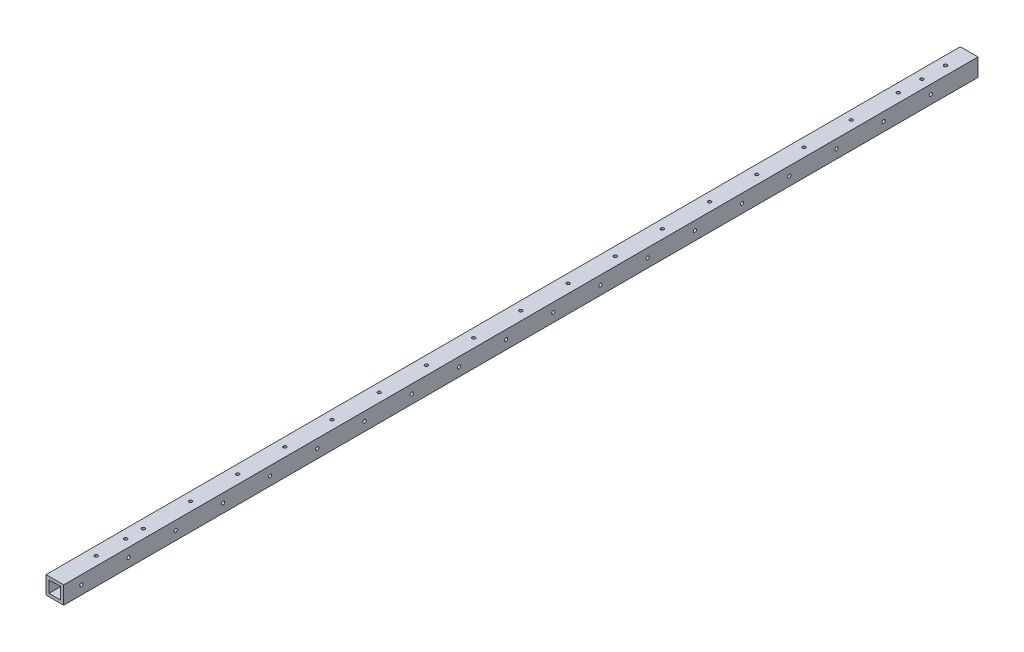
ISO-10303-21;
HEADER;
FILE_DESCRIPTION(('STEP AP214'),'2;1');
FILE_NAME('part.step','',(''),(''),'','','');
FILE_SCHEMA(('AUTOMOTIVE_DESIGN { 1 0 10303 214 1 1 1 1 }'));
ENDSEC;
DATA;
#1=APPLICATION_CONTEXT('core data for automotive mechanical design processes');
#2=APPLICATION_PROTOCOL_DEFINITION('international standard','automotive_design',2000,#1);
#3=PRODUCT_CONTEXT('',#1,'mechanical');
#4=PRODUCT('Part','Part','',(#3));
#5=PRODUCT_RELATED_PRODUCT_CATEGORY('part','',(#4));
#6=PRODUCT_DEFINITION_FORMATION('','',#4);
#7=PRODUCT_DEFINITION_CONTEXT('part definition',#1,'design');
#8=PRODUCT_DEFINITION('design','',#6,#7);
#9=PRODUCT_DEFINITION_SHAPE('','',#8);
#10=(LENGTH_UNIT() NAMED_UNIT(*) SI_UNIT(.MILLI.,.METRE.));
#11=(NAMED_UNIT(*) PLANE_ANGLE_UNIT() SI_UNIT($,.RADIAN.));
#12=(NAMED_UNIT(*) SI_UNIT($,.STERADIAN.) SOLID_ANGLE_UNIT());
#13=UNCERTAINTY_MEASURE_WITH_UNIT(LENGTH_MEASURE(1.E-05),#10,'distance_accuracy_value','');
#14=(GEOMETRIC_REPRESENTATION_CONTEXT(3) GLOBAL_UNCERTAINTY_ASSIGNED_CONTEXT((#13)) GLOBAL_UNIT_ASSIGNED_CONTEXT((#10,
#11,#12)) REPRESENTATION_CONTEXT('',''));
#15=CARTESIAN_POINT('',(0.,0.,0.));
#16=DIRECTION('',(0.,0.,1.));
#17=DIRECTION('',(1.,0.,0.));
#18=AXIS2_PLACEMENT_3D('',#15,#16,#17);
#19=CARTESIAN_POINT('',(-9.525,9.525,984.25));
#20=DIRECTION('',(0.,-1.,0.));
#21=DIRECTION('',(0.,0.,-1.));
#22=AXIS2_PLACEMENT_3D('',#19,#20,#21);
#23=PLANE('',#22);
#24=CARTESIAN_POINT('',(0.,9.525,939.800000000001));
#25=DIRECTION('',(0.,1.,0.));
#26=DIRECTION('',(0.,0.,1.));
#27=AXIS2_PLACEMENT_3D('',#24,#25,#26);
#28=CIRCLE('',#27,1.7272);
#29=CARTESIAN_POINT('',(0.,9.525,941.527200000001));
#30=VERTEX_POINT('',#29);
#31=EDGE_CURVE('E277',#30,#30,#28,.T.);
#32=ORIENTED_EDGE('',*,*,#31,.F.);
#33=EDGE_LOOP('',(#32));
#34=FACE_BOUND('',#33,.T.);
#35=CARTESIAN_POINT('',(0.,9.525,889.000000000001));
#36=DIRECTION('',(0.,1.,0.));
#37=DIRECTION('',(0.,0.,1.));
#38=AXIS2_PLACEMENT_3D('',#35,#36,#37);
#39=CIRCLE('',#38,1.7272);
#40=CARTESIAN_POINT('',(0.,9.525,890.727200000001));
#41=VERTEX_POINT('',#40);
#42=EDGE_CURVE('E271',#41,#41,#39,.T.);
#43=ORIENTED_EDGE('',*,*,#42,.F.);
#44=EDGE_LOOP('',(#43));
#45=FACE_BOUND('',#44,.T.);
#46=CARTESIAN_POINT('',(0.,9.525,838.200000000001));
#47=DIRECTION('',(0.,1.,0.));
#48=DIRECTION('',(0.,0.,1.));
#49=AXIS2_PLACEMENT_3D('',#46,#47,#48);
#50=CIRCLE('',#49,1.7272);
#51=CARTESIAN_POINT('',(0.,9.525,839.927200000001));
#52=VERTEX_POINT('',#51);
#53=EDGE_CURVE('E265',#52,#52,#50,.T.);
#54=ORIENTED_EDGE('',*,*,#53,.F.);
#55=EDGE_LOOP('',(#54));
#56=FACE_BOUND('',#55,.T.);
#57=CARTESIAN_POINT('',(0.,9.525,787.400000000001));
#58=DIRECTION('',(0.,1.,0.));
#59=DIRECTION('',(0.,0.,1.));
#60=AXIS2_PLACEMENT_3D('',#57,#58,#59);
#61=CIRCLE('',#60,1.7272);
#62=CARTESIAN_POINT('',(0.,9.525,789.127200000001));
#63=VERTEX_POINT('',#62);
#64=EDGE_CURVE('E259',#63,#63,#61,.T.);
#65=ORIENTED_EDGE('',*,*,#64,.F.);
#66=EDGE_LOOP('',(#65));
#67=FACE_BOUND('',#66,.T.);
#68=CARTESIAN_POINT('',(0.,9.525,736.600000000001));
#69=DIRECTION('',(0.,1.,0.));
#70=DIRECTION('',(0.,0.,1.));
#71=AXIS2_PLACEMENT_3D('',#68,#69,#70);
#72=CIRCLE('',#71,1.7272);
#73=CARTESIAN_POINT('',(0.,9.525,738.327200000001));
#74=VERTEX_POINT('',#73);
#75=EDGE_CURVE('E253',#74,#74,#72,.T.);
#76=ORIENTED_EDGE('',*,*,#75,.F.);
#77=EDGE_LOOP('',(#76));
#78=FACE_BOUND('',#77,.T.);
#79=CARTESIAN_POINT('',(0.,9.525,685.800000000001));
#80=DIRECTION('',(0.,1.,0.));
#81=DIRECTION('',(0.,0.,1.));
#82=AXIS2_PLACEMENT_3D('',#79,#80,#81);
#83=CIRCLE('',#82,1.7272);
#84=CARTESIAN_POINT('',(0.,9.525,687.527200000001));
#85=VERTEX_POINT('',#84);
#86=EDGE_CURVE('E247',#85,#85,#83,.T.);
#87=ORIENTED_EDGE('',*,*,#86,.F.);
#88=EDGE_LOOP('',(#87));
#89=FACE_BOUND('',#88,.T.);
#90=CARTESIAN_POINT('',(0.,9.525,635.000000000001));
#91=DIRECTION('',(0.,1.,0.));
#92=DIRECTION('',(0.,0.,1.));
#93=AXIS2_PLACEMENT_3D('',#90,#91,#92);
#94=CIRCLE('',#93,1.7272);
#95=CARTESIAN_POINT('',(0.,9.525,636.727200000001));
#96=VERTEX_POINT('',#95);
#97=EDGE_CURVE('E241',#96,#96,#94,.T.);
#98=ORIENTED_EDGE('',*,*,#97,.F.);
#99=EDGE_LOOP('',(#98));
#100=FACE_BOUND('',#99,.T.);
#101=CARTESIAN_POINT('',(0.,9.525,584.200000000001));
#102=DIRECTION('',(0.,1.,0.));
#103=DIRECTION('',(0.,0.,1.));
#104=AXIS2_PLACEMENT_3D('',#101,#102,#103);
#105=CIRCLE('',#104,1.7272);
#106=CARTESIAN_POINT('',(0.,9.525,585.927200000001));
#107=VERTEX_POINT('',#106);
#108=EDGE_CURVE('E235',#107,#107,#105,.T.);
#109=ORIENTED_EDGE('',*,*,#108,.F.);
#110=EDGE_LOOP('',(#109));
#111=FACE_BOUND('',#110,.T.);
#112=CARTESIAN_POINT('',(0.,9.525,533.4));
#113=DIRECTION('',(0.,1.,0.));
#114=DIRECTION('',(0.,0.,1.));
#115=AXIS2_PLACEMENT_3D('',#112,#113,#114);
#116=CIRCLE('',#115,1.7272);
#117=CARTESIAN_POINT('',(0.,9.525,535.1272));
#118=VERTEX_POINT('',#117);
#119=EDGE_CURVE('E229',#118,#118,#116,.T.);
#120=ORIENTED_EDGE('',*,*,#119,.F.);
#121=EDGE_LOOP('',(#120));
#122=FACE_BOUND('',#121,.T.);
#123=CARTESIAN_POINT('',(0.,9.525,482.6));
#124=DIRECTION('',(0.,1.,0.));
#125=DIRECTION('',(0.,0.,1.));
#126=AXIS2_PLACEMENT_3D('',#123,#124,#125);
#127=CIRCLE('',#126,1.7272);
#128=CARTESIAN_POINT('',(0.,9.525,484.3272));
#129=VERTEX_POINT('',#128);
#130=EDGE_CURVE('E223',#129,#129,#127,.T.);
#131=ORIENTED_EDGE('',*,*,#130,.F.);
#132=EDGE_LOOP('',(#131));
#133=FACE_BOUND('',#132,.T.);
#134=CARTESIAN_POINT('',(0.,9.525,431.8));
#135=DIRECTION('',(0.,1.,0.));
#136=DIRECTION('',(0.,0.,1.));
#137=AXIS2_PLACEMENT_3D('',#134,#135,#136);
#138=CIRCLE('',#137,1.7272);
#139=CARTESIAN_POINT('',(0.,9.525,433.5272));
#140=VERTEX_POINT('',#139);
#141=EDGE_CURVE('E217',#140,#140,#138,.T.);
#142=ORIENTED_EDGE('',*,*,#141,.F.);
#143=EDGE_LOOP('',(#142));
#144=FACE_BOUND('',#143,.T.);
#145=CARTESIAN_POINT('',(0.,9.525,381.));
#146=DIRECTION('',(0.,1.,0.));
#147=DIRECTION('',(0.,0.,1.));
#148=AXIS2_PLACEMENT_3D('',#145,#146,#147);
#149=CIRCLE('',#148,1.7272);
#150=CARTESIAN_POINT('',(0.,9.525,382.7272));
#151=VERTEX_POINT('',#150);
#152=EDGE_CURVE('E211',#151,#151,#149,.T.);
#153=ORIENTED_EDGE('',*,*,#152,.F.);
#154=EDGE_LOOP('',(#153));
#155=FACE_BOUND('',#154,.T.);
#156=CARTESIAN_POINT('',(0.,9.525,330.2));
#157=DIRECTION('',(0.,1.,0.));
#158=DIRECTION('',(0.,0.,1.));
#159=AXIS2_PLACEMENT_3D('',#156,#157,#158);
#160=CIRCLE('',#159,1.7272);
#161=CARTESIAN_POINT('',(0.,9.525,331.9272));
#162=VERTEX_POINT('',#161);
#163=EDGE_CURVE('E205',#162,#162,#160,.T.);
#164=ORIENTED_EDGE('',*,*,#163,.F.);
#165=EDGE_LOOP('',(#164));
#166=FACE_BOUND('',#165,.T.);
#167=CARTESIAN_POINT('',(0.,9.525,279.4));
#168=DIRECTION('',(0.,1.,0.));
#169=DIRECTION('',(0.,0.,1.));
#170=AXIS2_PLACEMENT_3D('',#167,#168,#169);
#171=CIRCLE('',#170,1.7272);
#172=CARTESIAN_POINT('',(0.,9.525,281.1272));
#173=VERTEX_POINT('',#172);
#174=EDGE_CURVE('E199',#173,#173,#171,.T.);
#175=ORIENTED_EDGE('',*,*,#174,.F.);
#176=EDGE_LOOP('',(#175));
#177=FACE_BOUND('',#176,.T.);
#178=CARTESIAN_POINT('',(0.,9.525,228.6));
#179=DIRECTION('',(0.,1.,0.));
#180=DIRECTION('',(0.,0.,1.));
#181=AXIS2_PLACEMENT_3D('',#178,#179,#180);
#182=CIRCLE('',#181,1.7272);
#183=CARTESIAN_POINT('',(0.,9.525,230.3272));
#184=VERTEX_POINT('',#183);
#185=EDGE_CURVE('E193',#184,#184,#182,.T.);
#186=ORIENTED_EDGE('',*,*,#185,.F.);
#187=EDGE_LOOP('',(#186));
#188=FACE_BOUND('',#187,.T.);
#189=CARTESIAN_POINT('',(0.,9.525,177.8));
#190=DIRECTION('',(0.,1.,0.));
#191=DIRECTION('',(0.,0.,1.));
#192=AXIS2_PLACEMENT_3D('',#189,#190,#191);
#193=CIRCLE('',#192,1.7272);
#194=CARTESIAN_POINT('',(0.,9.525,179.5272));
#195=VERTEX_POINT('',#194);
#196=EDGE_CURVE('E187',#195,#195,#193,.T.);
#197=ORIENTED_EDGE('',*,*,#196,.F.);
#198=EDGE_LOOP('',(#197));
#199=FACE_BOUND('',#198,.T.);
#200=CARTESIAN_POINT('',(0.,9.525,127.));
#201=DIRECTION('',(0.,1.,0.));
#202=DIRECTION('',(0.,0.,1.));
#203=AXIS2_PLACEMENT_3D('',#200,#201,#202);
#204=CIRCLE('',#203,1.7272);
#205=CARTESIAN_POINT('',(0.,9.525,128.7272));
#206=VERTEX_POINT('',#205);
#207=EDGE_CURVE('E181',#206,#206,#204,.T.);
#208=ORIENTED_EDGE('',*,*,#207,.F.);
#209=EDGE_LOOP('',(#208));
#210=FACE_BOUND('',#209,.T.);
#211=DIRECTION('',(-1.,0.,0.));
#212=VECTOR('',#211,1.);
#213=CARTESIAN_POINT('',(-9.525,9.525,0.));
#214=LINE('',#213,#212);
#215=CARTESIAN_POINT('',(9.525,9.525,0.));
#216=VERTEX_POINT('',#215);
#217=CARTESIAN_POINT('',(-9.525,9.525,0.));
#218=VERTEX_POINT('',#217);
#219=EDGE_CURVE('E148',#216,#218,#214,.T.);
#220=ORIENTED_EDGE('',*,*,#219,.T.);
#221=DIRECTION('',(0.,0.,-1.));
#222=VECTOR('',#221,1.);
#223=CARTESIAN_POINT('',(-9.525,9.525,984.25));
#224=LINE('',#223,#222);
#225=CARTESIAN_POINT('',(-9.525,9.525,984.25));
#226=VERTEX_POINT('',#225);
#227=EDGE_CURVE('E154',#226,#218,#224,.T.);
#228=ORIENTED_EDGE('',*,*,#227,.F.);
#229=DIRECTION('',(-1.,0.,0.));
#230=VECTOR('',#229,1.);
#231=CARTESIAN_POINT('',(-9.525,9.525,984.25));
#232=LINE('',#231,#230);
#233=CARTESIAN_POINT('',(9.525,9.525,984.25));
#234=VERTEX_POINT('',#233);
#235=EDGE_CURVE('E152',#234,#226,#232,.T.);
#236=ORIENTED_EDGE('',*,*,#235,.F.);
#237=DIRECTION('',(0.,0.,-1.));
#238=VECTOR('',#237,1.);
#239=CARTESIAN_POINT('',(9.525,9.525,984.25));
#240=LINE('',#239,#238);
#241=EDGE_CURVE('E164',#234,#216,#240,.T.);
#242=ORIENTED_EDGE('',*,*,#241,.T.);
#243=EDGE_LOOP('',(#220,#228,#236,#242));
#244=FACE_BOUND('',#243,.T.);
#245=CARTESIAN_POINT('',(0.,9.525,25.4));
#246=DIRECTION('',(0.,1.,0.));
#247=DIRECTION('',(0.,0.,1.));
#248=AXIS2_PLACEMENT_3D('',#245,#246,#247);
#249=CIRCLE('',#248,1.7272);
#250=CARTESIAN_POINT('',(0.,9.525,27.1272));
#251=VERTEX_POINT('',#250);
#252=EDGE_CURVE('E630',#251,#251,#249,.T.);
#253=ORIENTED_EDGE('',*,*,#252,.F.);
#254=EDGE_LOOP('',(#253));
#255=FACE_BOUND('',#254,.T.);
#256=CARTESIAN_POINT('',(0.,9.525,76.2));
#257=DIRECTION('',(0.,1.,0.));
#258=DIRECTION('',(0.,0.,1.));
#259=AXIS2_PLACEMENT_3D('',#256,#257,#258);
#260=CIRCLE('',#259,1.7272);
#261=CARTESIAN_POINT('',(0.,9.525,77.9272));
#262=VERTEX_POINT('',#261);
#263=EDGE_CURVE('E620',#262,#262,#260,.T.);
#264=ORIENTED_EDGE('',*,*,#263,.F.);
#265=EDGE_LOOP('',(#264));
#266=FACE_BOUND('',#265,.T.);
#267=CARTESIAN_POINT('',(0.,9.525,908.05));
#268=DIRECTION('',(0.,1.,0.));
#269=DIRECTION('',(0.,0.,1.));
#270=AXIS2_PLACEMENT_3D('',#267,#268,#269);
#271=CIRCLE('',#270,1.72719999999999);
#272=CARTESIAN_POINT('',(0.,9.525,909.7772));
#273=VERTEX_POINT('',#272);
#274=EDGE_CURVE('E591',#273,#273,#271,.T.);
#275=ORIENTED_EDGE('',*,*,#274,.F.);
#276=EDGE_LOOP('',(#275));
#277=FACE_BOUND('',#276,.T.);
#278=CARTESIAN_POINT('',(0.,9.525,50.8));
#279=DIRECTION('',(0.,1.,0.));
#280=DIRECTION('',(0.,0.,1.));
#281=AXIS2_PLACEMENT_3D('',#278,#279,#280);
#282=CIRCLE('',#281,1.72719999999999);
#283=CARTESIAN_POINT('',(0.,9.525,52.5272));
#284=VERTEX_POINT('',#283);
#285=EDGE_CURVE('E739',#284,#284,#282,.T.);
#286=ORIENTED_EDGE('',*,*,#285,.F.);
#287=EDGE_LOOP('',(#286));
#288=FACE_BOUND('',#287,.T.);
#289=ADVANCED_FACE('F36',(#34,#45,#56,#67,#78,#89,#100,#111,#122,#133,#144,#155,#166,#177,#188,
#199,#210,#244,#255,#266,#277,#288),#23,.F.);
#290=CARTESIAN_POINT('',(-9.525,-9.525,984.25));
#291=DIRECTION('',(0.,0.,1.));
#292=DIRECTION('',(1.,0.,0.));
#293=AXIS2_PLACEMENT_3D('',#290,#291,#292);
#294=PLANE('',#293);
#295=DIRECTION('',(0.,-1.,0.));
#296=VECTOR('',#295,1.);
#297=CARTESIAN_POINT('',(-9.525,9.525,984.25));
#298=LINE('',#297,#296);
#299=CARTESIAN_POINT('',(-9.525,-9.525,984.25));
#300=VERTEX_POINT('',#299);
#301=EDGE_CURVE('E144',#226,#300,#298,.T.);
#302=ORIENTED_EDGE('',*,*,#301,.T.);
#303=DIRECTION('',(1.,0.,0.));
#304=VECTOR('',#303,1.);
#305=CARTESIAN_POINT('',(-9.525,-9.525,984.25));
#306=LINE('',#305,#304);
#307=CARTESIAN_POINT('',(9.525,-9.525,984.25));
#308=VERTEX_POINT('',#307);
#309=EDGE_CURVE('E147',#300,#308,#306,.T.);
#310=ORIENTED_EDGE('',*,*,#309,.T.);
#311=DIRECTION('',(0.,1.,0.));
#312=VECTOR('',#311,1.);
#313=CARTESIAN_POINT('',(9.525,9.525,984.25));
#314=LINE('',#313,#312);
#315=EDGE_CURVE('E150',#308,#234,#314,.T.);
#316=ORIENTED_EDGE('',*,*,#315,.T.);
#317=ORIENTED_EDGE('',*,*,#235,.T.);
#318=EDGE_LOOP('',(#302,#310,#316,#317));
#319=FACE_BOUND('',#318,.T.);
#320=DIRECTION('',(1.,0.,0.));
#321=VECTOR('',#320,1.);
#322=CARTESIAN_POINT('',(-6.35,-6.35,984.25));
#323=LINE('',#322,#321);
#324=CARTESIAN_POINT('',(-6.35,-6.35,984.25));
#325=VERTEX_POINT('',#324);
#326=CARTESIAN_POINT('',(6.35,-6.35,984.25));
#327=VERTEX_POINT('',#326);
#328=EDGE_CURVE('E112',#325,#327,#323,.T.);
#329=ORIENTED_EDGE('',*,*,#328,.F.);
#330=DIRECTION('',(0.,-1.,0.));
#331=VECTOR('',#330,1.);
#332=CARTESIAN_POINT('',(-6.35,6.35,984.25));
#333=LINE('',#332,#331);
#334=CARTESIAN_POINT('',(-6.35,6.35,984.25));
#335=VERTEX_POINT('',#334);
#336=EDGE_CURVE('E103',#335,#325,#333,.T.);
#337=ORIENTED_EDGE('',*,*,#336,.F.);
#338=DIRECTION('',(-1.,0.,0.));
#339=VECTOR('',#338,1.);
#340=CARTESIAN_POINT('',(-6.35,6.35,984.25));
#341=LINE('',#340,#339);
#342=CARTESIAN_POINT('',(6.34999999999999,6.35,984.25));
#343=VERTEX_POINT('',#342);
#344=EDGE_CURVE('E128',#343,#335,#341,.T.);
#345=ORIENTED_EDGE('',*,*,#344,.F.);
#346=DIRECTION('',(0.,1.,0.));
#347=VECTOR('',#346,1.);
#348=CARTESIAN_POINT('',(6.35,6.35,984.25));
#349=LINE('',#348,#347);
#350=EDGE_CURVE('E126',#327,#343,#349,.T.);
#351=ORIENTED_EDGE('',*,*,#350,.F.);
#352=EDGE_LOOP('',(#329,#337,#345,#351));
#353=FACE_BOUND('',#352,.T.);
#354=ADVANCED_FACE('F125',(#319,#353),#294,.T.);
#355=CARTESIAN_POINT('',(-9.525,-9.525,0.));
#356=DIRECTION('',(0.,0.,1.));
#357=DIRECTION('',(1.,0.,0.));
#358=AXIS2_PLACEMENT_3D('',#355,#356,#357);
#359=PLANE('',#358);
#360=DIRECTION('',(0.,-1.,0.));
#361=VECTOR('',#360,1.);
#362=CARTESIAN_POINT('',(-9.525,9.525,0.));
#363=LINE('',#362,#361);
#364=CARTESIAN_POINT('',(-9.525,-9.525,0.));
#365=VERTEX_POINT('',#364);
#366=EDGE_CURVE('E121',#218,#365,#363,.T.);
#367=ORIENTED_EDGE('',*,*,#366,.F.);
#368=ORIENTED_EDGE('',*,*,#219,.F.);
#369=DIRECTION('',(0.,1.,0.));
#370=VECTOR('',#369,1.);
#371=CARTESIAN_POINT('',(9.525,9.525,0.));
#372=LINE('',#371,#370);
#373=CARTESIAN_POINT('',(9.525,-9.525,0.));
#374=VERTEX_POINT('',#373);
#375=EDGE_CURVE('E159',#374,#216,#372,.T.);
#376=ORIENTED_EDGE('',*,*,#375,.F.);
#377=DIRECTION('',(1.,0.,0.));
#378=VECTOR('',#377,1.);
#379=CARTESIAN_POINT('',(-9.525,-9.525,0.));
#380=LINE('',#379,#378);
#381=EDGE_CURVE('E157',#365,#374,#380,.T.);
#382=ORIENTED_EDGE('',*,*,#381,.F.);
#383=EDGE_LOOP('',(#367,#368,#376,#382));
#384=FACE_BOUND('',#383,.T.);
#385=DIRECTION('',(0.,-1.,0.));
#386=VECTOR('',#385,1.);
#387=CARTESIAN_POINT('',(-6.35,6.35,0.));
#388=LINE('',#387,#386);
#389=CARTESIAN_POINT('',(-6.35,6.35,0.));
#390=VERTEX_POINT('',#389);
#391=CARTESIAN_POINT('',(-6.35,-6.35,0.));
#392=VERTEX_POINT('',#391);
#393=EDGE_CURVE('E61',#390,#392,#388,.T.);
#394=ORIENTED_EDGE('',*,*,#393,.T.);
#395=DIRECTION('',(1.,0.,0.));
#396=VECTOR('',#395,1.);
#397=CARTESIAN_POINT('',(-6.35,-6.35,0.));
#398=LINE('',#397,#396);
#399=CARTESIAN_POINT('',(6.35,-6.35,0.));
#400=VERTEX_POINT('',#399);
#401=EDGE_CURVE('E120',#392,#400,#398,.T.);
#402=ORIENTED_EDGE('',*,*,#401,.T.);
#403=DIRECTION('',(0.,1.,0.));
#404=VECTOR('',#403,1.);
#405=CARTESIAN_POINT('',(6.35,6.35,0.));
#406=LINE('',#405,#404);
#407=CARTESIAN_POINT('',(6.35,6.35,0.));
#408=VERTEX_POINT('',#407);
#409=EDGE_CURVE('E136',#400,#408,#406,.T.);
#410=ORIENTED_EDGE('',*,*,#409,.T.);
#411=DIRECTION('',(-1.,0.,0.));
#412=VECTOR('',#411,1.);
#413=CARTESIAN_POINT('',(-6.35,6.35,0.));
#414=LINE('',#413,#412);
#415=EDGE_CURVE('E113',#408,#390,#414,.T.);
#416=ORIENTED_EDGE('',*,*,#415,.T.);
#417=EDGE_LOOP('',(#394,#402,#410,#416));
#418=FACE_BOUND('',#417,.T.);
#419=ADVANCED_FACE('F792',(#384,#418),#359,.F.);
#420=CARTESIAN_POINT('',(-9.525,9.525,984.25));
#421=DIRECTION('',(1.,0.,0.));
#422=DIRECTION('',(0.,1.,0.));
#423=AXIS2_PLACEMENT_3D('',#420,#421,#422);
#424=PLANE('',#423);
#425=CARTESIAN_POINT('',(-9.52500000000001,0.,101.6));
#426=DIRECTION('',(-1.,0.,0.));
#427=DIRECTION('',(0.,0.,1.));
#428=AXIS2_PLACEMENT_3D('',#425,#426,#427);
#429=CIRCLE('',#428,1.72719999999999);
#430=CARTESIAN_POINT('',(-9.52500000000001,0.,103.3272));
#431=VERTEX_POINT('',#430);
#432=EDGE_CURVE('E608',#431,#431,#429,.T.);
#433=ORIENTED_EDGE('',*,*,#432,.F.);
#434=EDGE_LOOP('',(#433));
#435=FACE_BOUND('',#434,.T.);
#436=CARTESIAN_POINT('',(-9.52500000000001,0.,50.8));
#437=DIRECTION('',(-1.,0.,0.));
#438=DIRECTION('',(0.,0.,1.));
#439=AXIS2_PLACEMENT_3D('',#436,#437,#438);
#440=CIRCLE('',#439,1.72719999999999);
#441=CARTESIAN_POINT('',(-9.52500000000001,0.,52.5272));
#442=VERTEX_POINT('',#441);
#443=EDGE_CURVE('E623',#442,#442,#440,.T.);
#444=ORIENTED_EDGE('',*,*,#443,.F.);
#445=EDGE_LOOP('',(#444));
#446=FACE_BOUND('',#445,.T.);
#447=ORIENTED_EDGE('',*,*,#366,.T.);
#448=DIRECTION('',(0.,0.,-1.));
#449=VECTOR('',#448,1.);
#450=CARTESIAN_POINT('',(-9.525,-9.525,984.25));
#451=LINE('',#450,#449);
#452=EDGE_CURVE('E170',#300,#365,#451,.T.);
#453=ORIENTED_EDGE('',*,*,#452,.F.);
#454=ORIENTED_EDGE('',*,*,#301,.F.);
#455=ORIENTED_EDGE('',*,*,#227,.T.);
#456=EDGE_LOOP('',(#447,#453,#454,#455));
#457=FACE_BOUND('',#456,.T.);
#458=CARTESIAN_POINT('',(-9.52500000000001,0.,152.4));
#459=DIRECTION('',(-1.,0.,0.));
#460=DIRECTION('',(0.,0.,1.));
#461=AXIS2_PLACEMENT_3D('',#458,#459,#460);
#462=CIRCLE('',#461,1.72719999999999);
#463=CARTESIAN_POINT('',(-9.52500000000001,0.,154.1272));
#464=VERTEX_POINT('',#463);
#465=EDGE_CURVE('E385',#464,#464,#462,.T.);
#466=ORIENTED_EDGE('',*,*,#465,.F.);
#467=EDGE_LOOP('',(#466));
#468=FACE_BOUND('',#467,.T.);
#469=CARTESIAN_POINT('',(-9.52500000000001,0.,203.2));
#470=DIRECTION('',(-1.,0.,0.));
#471=DIRECTION('',(0.,0.,1.));
#472=AXIS2_PLACEMENT_3D('',#469,#470,#471);
#473=CIRCLE('',#472,1.72719999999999);
#474=CARTESIAN_POINT('',(-9.52500000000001,0.,204.9272));
#475=VERTEX_POINT('',#474);
#476=EDGE_CURVE('E391',#475,#475,#473,.T.);
#477=ORIENTED_EDGE('',*,*,#476,.F.);
#478=EDGE_LOOP('',(#477));
#479=FACE_BOUND('',#478,.T.);
#480=CARTESIAN_POINT('',(-9.52500000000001,0.,254.));
#481=DIRECTION('',(-1.,0.,0.));
#482=DIRECTION('',(0.,0.,1.));
#483=AXIS2_PLACEMENT_3D('',#480,#481,#482);
#484=CIRCLE('',#483,1.72719999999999);
#485=CARTESIAN_POINT('',(-9.52500000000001,0.,255.7272));
#486=VERTEX_POINT('',#485);
#487=EDGE_CURVE('E397',#486,#486,#484,.T.);
#488=ORIENTED_EDGE('',*,*,#487,.F.);
#489=EDGE_LOOP('',(#488));
#490=FACE_BOUND('',#489,.T.);
#491=CARTESIAN_POINT('',(-9.52500000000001,0.,304.8));
#492=DIRECTION('',(-1.,0.,0.));
#493=DIRECTION('',(0.,0.,1.));
#494=AXIS2_PLACEMENT_3D('',#491,#492,#493);
#495=CIRCLE('',#494,1.72719999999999);
#496=CARTESIAN_POINT('',(-9.52500000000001,0.,306.5272));
#497=VERTEX_POINT('',#496);
#498=EDGE_CURVE('E403',#497,#497,#495,.T.);
#499=ORIENTED_EDGE('',*,*,#498,.F.);
#500=EDGE_LOOP('',(#499));
#501=FACE_BOUND('',#500,.T.);
#502=CARTESIAN_POINT('',(-9.52500000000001,0.,355.6));
#503=DIRECTION('',(-1.,0.,0.));
#504=DIRECTION('',(0.,0.,1.));
#505=AXIS2_PLACEMENT_3D('',#502,#503,#504);
#506=CIRCLE('',#505,1.72719999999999);
#507=CARTESIAN_POINT('',(-9.52500000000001,0.,357.3272));
#508=VERTEX_POINT('',#507);
#509=EDGE_CURVE('E409',#508,#508,#506,.T.);
#510=ORIENTED_EDGE('',*,*,#509,.F.);
#511=EDGE_LOOP('',(#510));
#512=FACE_BOUND('',#511,.T.);
#513=CARTESIAN_POINT('',(-9.52500000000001,0.,406.4));
#514=DIRECTION('',(-1.,0.,0.));
#515=DIRECTION('',(0.,0.,1.));
#516=AXIS2_PLACEMENT_3D('',#513,#514,#515);
#517=CIRCLE('',#516,1.72719999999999);
#518=CARTESIAN_POINT('',(-9.52500000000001,0.,408.1272));
#519=VERTEX_POINT('',#518);
#520=EDGE_CURVE('E415',#519,#519,#517,.T.);
#521=ORIENTED_EDGE('',*,*,#520,.F.);
#522=EDGE_LOOP('',(#521));
#523=FACE_BOUND('',#522,.T.);
#524=CARTESIAN_POINT('',(-9.52500000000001,0.,457.2));
#525=DIRECTION('',(-1.,0.,0.));
#526=DIRECTION('',(0.,0.,1.));
#527=AXIS2_PLACEMENT_3D('',#524,#525,#526);
#528=CIRCLE('',#527,1.72719999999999);
#529=CARTESIAN_POINT('',(-9.52500000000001,0.,458.9272));
#530=VERTEX_POINT('',#529);
#531=EDGE_CURVE('E421',#530,#530,#528,.T.);
#532=ORIENTED_EDGE('',*,*,#531,.F.);
#533=EDGE_LOOP('',(#532));
#534=FACE_BOUND('',#533,.T.);
#535=CARTESIAN_POINT('',(-9.52500000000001,0.,508.));
#536=DIRECTION('',(-1.,0.,0.));
#537=DIRECTION('',(0.,0.,1.));
#538=AXIS2_PLACEMENT_3D('',#535,#536,#537);
#539=CIRCLE('',#538,1.72719999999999);
#540=CARTESIAN_POINT('',(-9.52500000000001,0.,509.7272));
#541=VERTEX_POINT('',#540);
#542=EDGE_CURVE('E427',#541,#541,#539,.T.);
#543=ORIENTED_EDGE('',*,*,#542,.F.);
#544=EDGE_LOOP('',(#543));
#545=FACE_BOUND('',#544,.T.);
#546=CARTESIAN_POINT('',(-9.52500000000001,0.,558.8));
#547=DIRECTION('',(-1.,0.,0.));
#548=DIRECTION('',(0.,0.,1.));
#549=AXIS2_PLACEMENT_3D('',#546,#547,#548);
#550=CIRCLE('',#549,1.72719999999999);
#551=CARTESIAN_POINT('',(-9.52500000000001,0.,560.5272));
#552=VERTEX_POINT('',#551);
#553=EDGE_CURVE('E433',#552,#552,#550,.T.);
#554=ORIENTED_EDGE('',*,*,#553,.F.);
#555=EDGE_LOOP('',(#554));
#556=FACE_BOUND('',#555,.T.);
#557=CARTESIAN_POINT('',(-9.52500000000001,0.,609.6));
#558=DIRECTION('',(-1.,0.,0.));
#559=DIRECTION('',(0.,0.,1.));
#560=AXIS2_PLACEMENT_3D('',#557,#558,#559);
#561=CIRCLE('',#560,1.72719999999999);
#562=CARTESIAN_POINT('',(-9.52500000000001,0.,611.327200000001));
#563=VERTEX_POINT('',#562);
#564=EDGE_CURVE('E439',#563,#563,#561,.T.);
#565=ORIENTED_EDGE('',*,*,#564,.F.);
#566=EDGE_LOOP('',(#565));
#567=FACE_BOUND('',#566,.T.);
#568=CARTESIAN_POINT('',(-9.52500000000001,0.,660.400000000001));
#569=DIRECTION('',(-1.,0.,0.));
#570=DIRECTION('',(0.,0.,1.));
#571=AXIS2_PLACEMENT_3D('',#568,#569,#570);
#572=CIRCLE('',#571,1.72719999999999);
#573=CARTESIAN_POINT('',(-9.52500000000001,0.,662.127200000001));
#574=VERTEX_POINT('',#573);
#575=EDGE_CURVE('E445',#574,#574,#572,.T.);
#576=ORIENTED_EDGE('',*,*,#575,.F.);
#577=EDGE_LOOP('',(#576));
#578=FACE_BOUND('',#577,.T.);
#579=CARTESIAN_POINT('',(-9.52500000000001,0.,711.200000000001));
#580=DIRECTION('',(-1.,0.,0.));
#581=DIRECTION('',(0.,0.,1.));
#582=AXIS2_PLACEMENT_3D('',#579,#580,#581);
#583=CIRCLE('',#582,1.72719999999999);
#584=CARTESIAN_POINT('',(-9.52500000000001,0.,712.927200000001));
#585=VERTEX_POINT('',#584);
#586=EDGE_CURVE('E451',#585,#585,#583,.T.);
#587=ORIENTED_EDGE('',*,*,#586,.F.);
#588=EDGE_LOOP('',(#587));
#589=FACE_BOUND('',#588,.T.);
#590=CARTESIAN_POINT('',(-9.52500000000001,0.,762.000000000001));
#591=DIRECTION('',(-1.,0.,0.));
#592=DIRECTION('',(0.,0.,1.));
#593=AXIS2_PLACEMENT_3D('',#590,#591,#592);
#594=CIRCLE('',#593,1.72719999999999);
#595=CARTESIAN_POINT('',(-9.52500000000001,0.,763.727200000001));
#596=VERTEX_POINT('',#595);
#597=EDGE_CURVE('E457',#596,#596,#594,.T.);
#598=ORIENTED_EDGE('',*,*,#597,.F.);
#599=EDGE_LOOP('',(#598));
#600=FACE_BOUND('',#599,.T.);
#601=CARTESIAN_POINT('',(-9.52500000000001,0.,812.800000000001));
#602=DIRECTION('',(-1.,0.,0.));
#603=DIRECTION('',(0.,0.,1.));
#604=AXIS2_PLACEMENT_3D('',#601,#602,#603);
#605=CIRCLE('',#604,1.72719999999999);
#606=CARTESIAN_POINT('',(-9.52500000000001,0.,814.527200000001));
#607=VERTEX_POINT('',#606);
#608=EDGE_CURVE('E463',#607,#607,#605,.T.);
#609=ORIENTED_EDGE('',*,*,#608,.F.);
#610=EDGE_LOOP('',(#609));
#611=FACE_BOUND('',#610,.T.);
#612=CARTESIAN_POINT('',(-9.52500000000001,0.,863.600000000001));
#613=DIRECTION('',(-1.,0.,0.));
#614=DIRECTION('',(0.,0.,1.));
#615=AXIS2_PLACEMENT_3D('',#612,#613,#614);
#616=CIRCLE('',#615,1.72719999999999);
#617=CARTESIAN_POINT('',(-9.52500000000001,0.,865.327200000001));
#618=VERTEX_POINT('',#617);
#619=EDGE_CURVE('E469',#618,#618,#616,.T.);
#620=ORIENTED_EDGE('',*,*,#619,.F.);
#621=EDGE_LOOP('',(#620));
#622=FACE_BOUND('',#621,.T.);
#623=CARTESIAN_POINT('',(-9.52500000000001,0.,914.400000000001));
#624=DIRECTION('',(-1.,0.,0.));
#625=DIRECTION('',(0.,0.,1.));
#626=AXIS2_PLACEMENT_3D('',#623,#624,#625);
#627=CIRCLE('',#626,1.72719999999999);
#628=CARTESIAN_POINT('',(-9.52500000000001,0.,916.127200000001));
#629=VERTEX_POINT('',#628);
#630=EDGE_CURVE('E475',#629,#629,#627,.T.);
#631=ORIENTED_EDGE('',*,*,#630,.F.);
#632=EDGE_LOOP('',(#631));
#633=FACE_BOUND('',#632,.T.);
#634=CARTESIAN_POINT('',(-9.52500000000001,0.,965.200000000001));
#635=DIRECTION('',(-1.,0.,0.));
#636=DIRECTION('',(0.,0.,1.));
#637=AXIS2_PLACEMENT_3D('',#634,#635,#636);
#638=CIRCLE('',#637,1.72719999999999);
#639=CARTESIAN_POINT('',(-9.52500000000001,0.,966.927200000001));
#640=VERTEX_POINT('',#639);
#641=EDGE_CURVE('E481',#640,#640,#638,.T.);
#642=ORIENTED_EDGE('',*,*,#641,.F.);
#643=EDGE_LOOP('',(#642));
#644=FACE_BOUND('',#643,.T.);
#645=ADVANCED_FACE('F795',(#435,#446,#457,#468,#479,#490,#501,#512,#523,#534,#545,#556,#567,
#578,#589,#600,#611,#622,#633,#644),#424,.F.);
#646=CARTESIAN_POINT('',(-9.525,-9.525,984.25));
#647=DIRECTION('',(0.,1.,0.));
#648=DIRECTION('',(0.,0.,1.));
#649=AXIS2_PLACEMENT_3D('',#646,#647,#648);
#650=PLANE('',#649);
#651=CARTESIAN_POINT('',(0.,-9.525,50.8));
#652=DIRECTION('',(0.,1.,0.));
#653=DIRECTION('',(0.,0.,1.));
#654=AXIS2_PLACEMENT_3D('',#651,#652,#653);
#655=CIRCLE('',#654,1.7272);
#656=CARTESIAN_POINT('',(0.,-9.525,52.5272));
#657=VERTEX_POINT('',#656);
#658=EDGE_CURVE('E741',#657,#657,#655,.T.);
#659=ORIENTED_EDGE('',*,*,#658,.T.);
#660=EDGE_LOOP('',(#659));
#661=FACE_BOUND('',#660,.T.);
#662=CARTESIAN_POINT('',(0.,-9.525,908.05));
#663=DIRECTION('',(0.,1.,0.));
#664=DIRECTION('',(0.,0.,1.));
#665=AXIS2_PLACEMENT_3D('',#662,#663,#664);
#666=CIRCLE('',#665,1.7272);
#667=CARTESIAN_POINT('',(0.,-9.525,909.7772));
#668=VERTEX_POINT('',#667);
#669=EDGE_CURVE('E584',#668,#668,#666,.T.);
#670=ORIENTED_EDGE('',*,*,#669,.T.);
#671=EDGE_LOOP('',(#670));
#672=FACE_BOUND('',#671,.T.);
#673=CARTESIAN_POINT('',(0.,-9.525,76.2));
#674=DIRECTION('',(0.,1.,0.));
#675=DIRECTION('',(0.,0.,1.));
#676=AXIS2_PLACEMENT_3D('',#673,#674,#675);
#677=CIRCLE('',#676,1.7272);
#678=CARTESIAN_POINT('',(0.,-9.525,77.9272));
#679=VERTEX_POINT('',#678);
#680=EDGE_CURVE('E614',#679,#679,#677,.T.);
#681=ORIENTED_EDGE('',*,*,#680,.T.);
#682=EDGE_LOOP('',(#681));
#683=FACE_BOUND('',#682,.T.);
#684=CARTESIAN_POINT('',(0.,-9.525,25.4));
#685=DIRECTION('',(0.,1.,0.));
#686=DIRECTION('',(0.,0.,1.));
#687=AXIS2_PLACEMENT_3D('',#684,#685,#686);
#688=CIRCLE('',#687,1.7272);
#689=CARTESIAN_POINT('',(0.,-9.525,27.1272));
#690=VERTEX_POINT('',#689);
#691=EDGE_CURVE('E633',#690,#690,#688,.T.);
#692=ORIENTED_EDGE('',*,*,#691,.T.);
#693=EDGE_LOOP('',(#692));
#694=FACE_BOUND('',#693,.T.);
#695=ORIENTED_EDGE('',*,*,#381,.T.);
#696=DIRECTION('',(0.,0.,-1.));
#697=VECTOR('',#696,1.);
#698=CARTESIAN_POINT('',(9.525,-9.525,984.25));
#699=LINE('',#698,#697);
#700=EDGE_CURVE('E167',#308,#374,#699,.T.);
#701=ORIENTED_EDGE('',*,*,#700,.F.);
#702=ORIENTED_EDGE('',*,*,#309,.F.);
#703=ORIENTED_EDGE('',*,*,#452,.T.);
#704=EDGE_LOOP('',(#695,#701,#702,#703));
#705=FACE_BOUND('',#704,.T.);
#706=CARTESIAN_POINT('',(0.,-9.525,127.));
#707=DIRECTION('',(0.,1.,0.));
#708=DIRECTION('',(0.,0.,1.));
#709=AXIS2_PLACEMENT_3D('',#706,#707,#708);
#710=CIRCLE('',#709,1.7272);
#711=CARTESIAN_POINT('',(0.,-9.525,128.7272));
#712=VERTEX_POINT('',#711);
#713=EDGE_CURVE('E283',#712,#712,#710,.T.);
#714=ORIENTED_EDGE('',*,*,#713,.T.);
#715=EDGE_LOOP('',(#714));
#716=FACE_BOUND('',#715,.T.);
#717=CARTESIAN_POINT('',(0.,-9.525,177.8));
#718=DIRECTION('',(0.,1.,0.));
#719=DIRECTION('',(0.,0.,1.));
#720=AXIS2_PLACEMENT_3D('',#717,#718,#719);
#721=CIRCLE('',#720,1.7272);
#722=CARTESIAN_POINT('',(0.,-9.525,179.5272));
#723=VERTEX_POINT('',#722);
#724=EDGE_CURVE('E289',#723,#723,#721,.T.);
#725=ORIENTED_EDGE('',*,*,#724,.T.);
#726=EDGE_LOOP('',(#725));
#727=FACE_BOUND('',#726,.T.);
#728=CARTESIAN_POINT('',(0.,-9.525,228.6));
#729=DIRECTION('',(0.,1.,0.));
#730=DIRECTION('',(0.,0.,1.));
#731=AXIS2_PLACEMENT_3D('',#728,#729,#730);
#732=CIRCLE('',#731,1.7272);
#733=CARTESIAN_POINT('',(0.,-9.525,230.3272));
#734=VERTEX_POINT('',#733);
#735=EDGE_CURVE('E295',#734,#734,#732,.T.);
#736=ORIENTED_EDGE('',*,*,#735,.T.);
#737=EDGE_LOOP('',(#736));
#738=FACE_BOUND('',#737,.T.);
#739=CARTESIAN_POINT('',(0.,-9.525,279.4));
#740=DIRECTION('',(0.,1.,0.));
#741=DIRECTION('',(0.,0.,1.));
#742=AXIS2_PLACEMENT_3D('',#739,#740,#741);
#743=CIRCLE('',#742,1.7272);
#744=CARTESIAN_POINT('',(0.,-9.525,281.1272));
#745=VERTEX_POINT('',#744);
#746=EDGE_CURVE('E301',#745,#745,#743,.T.);
#747=ORIENTED_EDGE('',*,*,#746,.T.);
#748=EDGE_LOOP('',(#747));
#749=FACE_BOUND('',#748,.T.);
#750=CARTESIAN_POINT('',(0.,-9.525,330.2));
#751=DIRECTION('',(0.,1.,0.));
#752=DIRECTION('',(0.,0.,1.));
#753=AXIS2_PLACEMENT_3D('',#750,#751,#752);
#754=CIRCLE('',#753,1.7272);
#755=CARTESIAN_POINT('',(0.,-9.525,331.9272));
#756=VERTEX_POINT('',#755);
#757=EDGE_CURVE('E307',#756,#756,#754,.T.);
#758=ORIENTED_EDGE('',*,*,#757,.T.);
#759=EDGE_LOOP('',(#758));
#760=FACE_BOUND('',#759,.T.);
#761=CARTESIAN_POINT('',(0.,-9.525,381.));
#762=DIRECTION('',(0.,1.,0.));
#763=DIRECTION('',(0.,0.,1.));
#764=AXIS2_PLACEMENT_3D('',#761,#762,#763);
#765=CIRCLE('',#764,1.7272);
#766=CARTESIAN_POINT('',(0.,-9.525,382.7272));
#767=VERTEX_POINT('',#766);
#768=EDGE_CURVE('E313',#767,#767,#765,.T.);
#769=ORIENTED_EDGE('',*,*,#768,.T.);
#770=EDGE_LOOP('',(#769));
#771=FACE_BOUND('',#770,.T.);
#772=CARTESIAN_POINT('',(0.,-9.525,431.8));
#773=DIRECTION('',(0.,1.,0.));
#774=DIRECTION('',(0.,0.,1.));
#775=AXIS2_PLACEMENT_3D('',#772,#773,#774);
#776=CIRCLE('',#775,1.7272);
#777=CARTESIAN_POINT('',(0.,-9.525,433.5272));
#778=VERTEX_POINT('',#777);
#779=EDGE_CURVE('E319',#778,#778,#776,.T.);
#780=ORIENTED_EDGE('',*,*,#779,.T.);
#781=EDGE_LOOP('',(#780));
#782=FACE_BOUND('',#781,.T.);
#783=CARTESIAN_POINT('',(0.,-9.525,482.6));
#784=DIRECTION('',(0.,1.,0.));
#785=DIRECTION('',(0.,0.,1.));
#786=AXIS2_PLACEMENT_3D('',#783,#784,#785);
#787=CIRCLE('',#786,1.7272);
#788=CARTESIAN_POINT('',(0.,-9.525,484.3272));
#789=VERTEX_POINT('',#788);
#790=EDGE_CURVE('E325',#789,#789,#787,.T.);
#791=ORIENTED_EDGE('',*,*,#790,.T.);
#792=EDGE_LOOP('',(#791));
#793=FACE_BOUND('',#792,.T.);
#794=CARTESIAN_POINT('',(0.,-9.525,533.4));
#795=DIRECTION('',(0.,1.,0.));
#796=DIRECTION('',(0.,0.,1.));
#797=AXIS2_PLACEMENT_3D('',#794,#795,#796);
#798=CIRCLE('',#797,1.7272);
#799=CARTESIAN_POINT('',(0.,-9.525,535.1272));
#800=VERTEX_POINT('',#799);
#801=EDGE_CURVE('E331',#800,#800,#798,.T.);
#802=ORIENTED_EDGE('',*,*,#801,.T.);
#803=EDGE_LOOP('',(#802));
#804=FACE_BOUND('',#803,.T.);
#805=CARTESIAN_POINT('',(0.,-9.525,584.200000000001));
#806=DIRECTION('',(0.,1.,0.));
#807=DIRECTION('',(0.,0.,1.));
#808=AXIS2_PLACEMENT_3D('',#805,#806,#807);
#809=CIRCLE('',#808,1.7272);
#810=CARTESIAN_POINT('',(0.,-9.525,585.927200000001));
#811=VERTEX_POINT('',#810);
#812=EDGE_CURVE('E337',#811,#811,#809,.T.);
#813=ORIENTED_EDGE('',*,*,#812,.T.);
#814=EDGE_LOOP('',(#813));
#815=FACE_BOUND('',#814,.T.);
#816=CARTESIAN_POINT('',(0.,-9.525,635.000000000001));
#817=DIRECTION('',(0.,1.,0.));
#818=DIRECTION('',(0.,0.,1.));
#819=AXIS2_PLACEMENT_3D('',#816,#817,#818);
#820=CIRCLE('',#819,1.7272);
#821=CARTESIAN_POINT('',(0.,-9.525,636.727200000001));
#822=VERTEX_POINT('',#821);
#823=EDGE_CURVE('E343',#822,#822,#820,.T.);
#824=ORIENTED_EDGE('',*,*,#823,.T.);
#825=EDGE_LOOP('',(#824));
#826=FACE_BOUND('',#825,.T.);
#827=CARTESIAN_POINT('',(0.,-9.525,685.800000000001));
#828=DIRECTION('',(0.,1.,0.));
#829=DIRECTION('',(0.,0.,1.));
#830=AXIS2_PLACEMENT_3D('',#827,#828,#829);
#831=CIRCLE('',#830,1.7272);
#832=CARTESIAN_POINT('',(0.,-9.525,687.527200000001));
#833=VERTEX_POINT('',#832);
#834=EDGE_CURVE('E349',#833,#833,#831,.T.);
#835=ORIENTED_EDGE('',*,*,#834,.T.);
#836=EDGE_LOOP('',(#835));
#837=FACE_BOUND('',#836,.T.);
#838=CARTESIAN_POINT('',(0.,-9.525,736.600000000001));
#839=DIRECTION('',(0.,1.,0.));
#840=DIRECTION('',(0.,0.,1.));
#841=AXIS2_PLACEMENT_3D('',#838,#839,#840);
#842=CIRCLE('',#841,1.7272);
#843=CARTESIAN_POINT('',(0.,-9.525,738.327200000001));
#844=VERTEX_POINT('',#843);
#845=EDGE_CURVE('E355',#844,#844,#842,.T.);
#846=ORIENTED_EDGE('',*,*,#845,.T.);
#847=EDGE_LOOP('',(#846));
#848=FACE_BOUND('',#847,.T.);
#849=CARTESIAN_POINT('',(0.,-9.525,787.400000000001));
#850=DIRECTION('',(0.,1.,0.));
#851=DIRECTION('',(0.,0.,1.));
#852=AXIS2_PLACEMENT_3D('',#849,#850,#851);
#853=CIRCLE('',#852,1.7272);
#854=CARTESIAN_POINT('',(0.,-9.525,789.127200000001));
#855=VERTEX_POINT('',#854);
#856=EDGE_CURVE('E361',#855,#855,#853,.T.);
#857=ORIENTED_EDGE('',*,*,#856,.T.);
#858=EDGE_LOOP('',(#857));
#859=FACE_BOUND('',#858,.T.);
#860=CARTESIAN_POINT('',(0.,-9.525,838.200000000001));
#861=DIRECTION('',(0.,1.,0.));
#862=DIRECTION('',(0.,0.,1.));
#863=AXIS2_PLACEMENT_3D('',#860,#861,#862);
#864=CIRCLE('',#863,1.7272);
#865=CARTESIAN_POINT('',(0.,-9.525,839.927200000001));
#866=VERTEX_POINT('',#865);
#867=EDGE_CURVE('E367',#866,#866,#864,.T.);
#868=ORIENTED_EDGE('',*,*,#867,.T.);
#869=EDGE_LOOP('',(#868));
#870=FACE_BOUND('',#869,.T.);
#871=CARTESIAN_POINT('',(0.,-9.525,889.000000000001));
#872=DIRECTION('',(0.,1.,0.));
#873=DIRECTION('',(0.,0.,1.));
#874=AXIS2_PLACEMENT_3D('',#871,#872,#873);
#875=CIRCLE('',#874,1.7272);
#876=CARTESIAN_POINT('',(0.,-9.525,890.727200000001));
#877=VERTEX_POINT('',#876);
#878=EDGE_CURVE('E373',#877,#877,#875,.T.);
#879=ORIENTED_EDGE('',*,*,#878,.T.);
#880=EDGE_LOOP('',(#879));
#881=FACE_BOUND('',#880,.T.);
#882=CARTESIAN_POINT('',(0.,-9.525,939.800000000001));
#883=DIRECTION('',(0.,1.,0.));
#884=DIRECTION('',(0.,0.,1.));
#885=AXIS2_PLACEMENT_3D('',#882,#883,#884);
#886=CIRCLE('',#885,1.7272);
#887=CARTESIAN_POINT('',(0.,-9.525,941.527200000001));
#888=VERTEX_POINT('',#887);
#889=EDGE_CURVE('E379',#888,#888,#886,.T.);
#890=ORIENTED_EDGE('',*,*,#889,.T.);
#891=EDGE_LOOP('',(#890));
#892=FACE_BOUND('',#891,.T.);
#893=ADVANCED_FACE('F800',(#661,#672,#683,#694,#705,#716,#727,#738,#749,#760,#771,#782,#793,
#804,#815,#826,#837,#848,#859,#870,#881,#892),#650,.F.);
#894=CARTESIAN_POINT('',(9.525,9.525,984.25));
#895=DIRECTION('',(-1.,0.,0.));
#896=DIRECTION('',(0.,-1.,0.));
#897=AXIS2_PLACEMENT_3D('',#894,#895,#896);
#898=PLANE('',#897);
#899=CARTESIAN_POINT('',(9.525,0.,101.6));
#900=DIRECTION('',(-1.,0.,0.));
#901=DIRECTION('',(0.,0.,1.));
#902=AXIS2_PLACEMENT_3D('',#899,#900,#901);
#903=CIRCLE('',#902,1.7272);
#904=CARTESIAN_POINT('',(9.525,0.,103.3272));
#905=VERTEX_POINT('',#904);
#906=EDGE_CURVE('E602',#905,#905,#903,.T.);
#907=ORIENTED_EDGE('',*,*,#906,.T.);
#908=EDGE_LOOP('',(#907));
#909=FACE_BOUND('',#908,.T.);
#910=CARTESIAN_POINT('',(9.525,0.,50.8));
#911=DIRECTION('',(-1.,0.,0.));
#912=DIRECTION('',(0.,0.,1.));
#913=AXIS2_PLACEMENT_3D('',#910,#911,#912);
#914=CIRCLE('',#913,1.7272);
#915=CARTESIAN_POINT('',(9.525,0.,52.5272));
#916=VERTEX_POINT('',#915);
#917=EDGE_CURVE('E178',#916,#916,#914,.T.);
#918=ORIENTED_EDGE('',*,*,#917,.T.);
#919=EDGE_LOOP('',(#918));
#920=FACE_BOUND('',#919,.T.);
#921=ORIENTED_EDGE('',*,*,#375,.T.);
#922=ORIENTED_EDGE('',*,*,#241,.F.);
#923=ORIENTED_EDGE('',*,*,#315,.F.);
#924=ORIENTED_EDGE('',*,*,#700,.T.);
#925=EDGE_LOOP('',(#921,#922,#923,#924));
#926=FACE_BOUND('',#925,.T.);
#927=CARTESIAN_POINT('',(9.525,0.,152.4));
#928=DIRECTION('',(-1.,0.,0.));
#929=DIRECTION('',(0.,0.,1.));
#930=AXIS2_PLACEMENT_3D('',#927,#928,#929);
#931=CIRCLE('',#930,1.7272);
#932=CARTESIAN_POINT('',(9.525,0.,154.1272));
#933=VERTEX_POINT('',#932);
#934=EDGE_CURVE('E487',#933,#933,#931,.T.);
#935=ORIENTED_EDGE('',*,*,#934,.T.);
#936=EDGE_LOOP('',(#935));
#937=FACE_BOUND('',#936,.T.);
#938=CARTESIAN_POINT('',(9.525,0.,203.2));
#939=DIRECTION('',(-1.,0.,0.));
#940=DIRECTION('',(0.,0.,1.));
#941=AXIS2_PLACEMENT_3D('',#938,#939,#940);
#942=CIRCLE('',#941,1.7272);
#943=CARTESIAN_POINT('',(9.525,0.,204.9272));
#944=VERTEX_POINT('',#943);
#945=EDGE_CURVE('E493',#944,#944,#942,.T.);
#946=ORIENTED_EDGE('',*,*,#945,.T.);
#947=EDGE_LOOP('',(#946));
#948=FACE_BOUND('',#947,.T.);
#949=CARTESIAN_POINT('',(9.525,0.,254.));
#950=DIRECTION('',(-1.,0.,0.));
#951=DIRECTION('',(0.,0.,1.));
#952=AXIS2_PLACEMENT_3D('',#949,#950,#951);
#953=CIRCLE('',#952,1.7272);
#954=CARTESIAN_POINT('',(9.525,0.,255.7272));
#955=VERTEX_POINT('',#954);
#956=EDGE_CURVE('E499',#955,#955,#953,.T.);
#957=ORIENTED_EDGE('',*,*,#956,.T.);
#958=EDGE_LOOP('',(#957));
#959=FACE_BOUND('',#958,.T.);
#960=CARTESIAN_POINT('',(9.525,0.,304.8));
#961=DIRECTION('',(-1.,0.,0.));
#962=DIRECTION('',(0.,0.,1.));
#963=AXIS2_PLACEMENT_3D('',#960,#961,#962);
#964=CIRCLE('',#963,1.7272);
#965=CARTESIAN_POINT('',(9.525,0.,306.5272));
#966=VERTEX_POINT('',#965);
#967=EDGE_CURVE('E505',#966,#966,#964,.T.);
#968=ORIENTED_EDGE('',*,*,#967,.T.);
#969=EDGE_LOOP('',(#968));
#970=FACE_BOUND('',#969,.T.);
#971=CARTESIAN_POINT('',(9.525,0.,355.6));
#972=DIRECTION('',(-1.,0.,0.));
#973=DIRECTION('',(0.,0.,1.));
#974=AXIS2_PLACEMENT_3D('',#971,#972,#973);
#975=CIRCLE('',#974,1.7272);
#976=CARTESIAN_POINT('',(9.525,0.,357.3272));
#977=VERTEX_POINT('',#976);
#978=EDGE_CURVE('E511',#977,#977,#975,.T.);
#979=ORIENTED_EDGE('',*,*,#978,.T.);
#980=EDGE_LOOP('',(#979));
#981=FACE_BOUND('',#980,.T.);
#982=CARTESIAN_POINT('',(9.525,0.,406.4));
#983=DIRECTION('',(-1.,0.,0.));
#984=DIRECTION('',(0.,0.,1.));
#985=AXIS2_PLACEMENT_3D('',#982,#983,#984);
#986=CIRCLE('',#985,1.7272);
#987=CARTESIAN_POINT('',(9.525,0.,408.1272));
#988=VERTEX_POINT('',#987);
#989=EDGE_CURVE('E517',#988,#988,#986,.T.);
#990=ORIENTED_EDGE('',*,*,#989,.T.);
#991=EDGE_LOOP('',(#990));
#992=FACE_BOUND('',#991,.T.);
#993=CARTESIAN_POINT('',(9.525,0.,457.2));
#994=DIRECTION('',(-1.,0.,0.));
#995=DIRECTION('',(0.,0.,1.));
#996=AXIS2_PLACEMENT_3D('',#993,#994,#995);
#997=CIRCLE('',#996,1.7272);
#998=CARTESIAN_POINT('',(9.525,0.,458.9272));
#999=VERTEX_POINT('',#998);
#1000=EDGE_CURVE('E523',#999,#999,#997,.T.);
#1001=ORIENTED_EDGE('',*,*,#1000,.T.);
#1002=EDGE_LOOP('',(#1001));
#1003=FACE_BOUND('',#1002,.T.);
#1004=CARTESIAN_POINT('',(9.525,0.,508.));
#1005=DIRECTION('',(-1.,0.,0.));
#1006=DIRECTION('',(0.,0.,1.));
#1007=AXIS2_PLACEMENT_3D('',#1004,#1005,#1006);
#1008=CIRCLE('',#1007,1.7272);
#1009=CARTESIAN_POINT('',(9.525,0.,509.7272));
#1010=VERTEX_POINT('',#1009);
#1011=EDGE_CURVE('E529',#1010,#1010,#1008,.T.);
#1012=ORIENTED_EDGE('',*,*,#1011,.T.);
#1013=EDGE_LOOP('',(#1012));
#1014=FACE_BOUND('',#1013,.T.);
#1015=CARTESIAN_POINT('',(9.525,0.,558.8));
#1016=DIRECTION('',(-1.,0.,0.));
#1017=DIRECTION('',(0.,0.,1.));
#1018=AXIS2_PLACEMENT_3D('',#1015,#1016,#1017);
#1019=CIRCLE('',#1018,1.7272);
#1020=CARTESIAN_POINT('',(9.525,0.,560.5272));
#1021=VERTEX_POINT('',#1020);
#1022=EDGE_CURVE('E535',#1021,#1021,#1019,.T.);
#1023=ORIENTED_EDGE('',*,*,#1022,.T.);
#1024=EDGE_LOOP('',(#1023));
#1025=FACE_BOUND('',#1024,.T.);
#1026=CARTESIAN_POINT('',(9.525,0.,609.6));
#1027=DIRECTION('',(-1.,0.,0.));
#1028=DIRECTION('',(0.,0.,1.));
#1029=AXIS2_PLACEMENT_3D('',#1026,#1027,#1028);
#1030=CIRCLE('',#1029,1.7272);
#1031=CARTESIAN_POINT('',(9.525,0.,611.327200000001));
#1032=VERTEX_POINT('',#1031);
#1033=EDGE_CURVE('E541',#1032,#1032,#1030,.T.);
#1034=ORIENTED_EDGE('',*,*,#1033,.T.);
#1035=EDGE_LOOP('',(#1034));
#1036=FACE_BOUND('',#1035,.T.);
#1037=CARTESIAN_POINT('',(9.525,0.,660.400000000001));
#1038=DIRECTION('',(-1.,0.,0.));
#1039=DIRECTION('',(0.,0.,1.));
#1040=AXIS2_PLACEMENT_3D('',#1037,#1038,#1039);
#1041=CIRCLE('',#1040,1.7272);
#1042=CARTESIAN_POINT('',(9.525,0.,662.127200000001));
#1043=VERTEX_POINT('',#1042);
#1044=EDGE_CURVE('E547',#1043,#1043,#1041,.T.);
#1045=ORIENTED_EDGE('',*,*,#1044,.T.);
#1046=EDGE_LOOP('',(#1045));
#1047=FACE_BOUND('',#1046,.T.);
#1048=CARTESIAN_POINT('',(9.525,0.,711.200000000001));
#1049=DIRECTION('',(-1.,0.,0.));
#1050=DIRECTION('',(0.,0.,1.));
#1051=AXIS2_PLACEMENT_3D('',#1048,#1049,#1050);
#1052=CIRCLE('',#1051,1.7272);
#1053=CARTESIAN_POINT('',(9.525,0.,712.927200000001));
#1054=VERTEX_POINT('',#1053);
#1055=EDGE_CURVE('E553',#1054,#1054,#1052,.T.);
#1056=ORIENTED_EDGE('',*,*,#1055,.T.);
#1057=EDGE_LOOP('',(#1056));
#1058=FACE_BOUND('',#1057,.T.);
#1059=CARTESIAN_POINT('',(9.525,0.,762.000000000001));
#1060=DIRECTION('',(-1.,0.,0.));
#1061=DIRECTION('',(0.,0.,1.));
#1062=AXIS2_PLACEMENT_3D('',#1059,#1060,#1061);
#1063=CIRCLE('',#1062,1.7272);
#1064=CARTESIAN_POINT('',(9.525,0.,763.727200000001));
#1065=VERTEX_POINT('',#1064);
#1066=EDGE_CURVE('E559',#1065,#1065,#1063,.T.);
#1067=ORIENTED_EDGE('',*,*,#1066,.T.);
#1068=EDGE_LOOP('',(#1067));
#1069=FACE_BOUND('',#1068,.T.);
#1070=CARTESIAN_POINT('',(9.525,0.,812.800000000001));
#1071=DIRECTION('',(-1.,0.,0.));
#1072=DIRECTION('',(0.,0.,1.));
#1073=AXIS2_PLACEMENT_3D('',#1070,#1071,#1072);
#1074=CIRCLE('',#1073,1.7272);
#1075=CARTESIAN_POINT('',(9.525,0.,814.527200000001));
#1076=VERTEX_POINT('',#1075);
#1077=EDGE_CURVE('E565',#1076,#1076,#1074,.T.);
#1078=ORIENTED_EDGE('',*,*,#1077,.T.);
#1079=EDGE_LOOP('',(#1078));
#1080=FACE_BOUND('',#1079,.T.);
#1081=CARTESIAN_POINT('',(9.525,0.,863.600000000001));
#1082=DIRECTION('',(-1.,0.,0.));
#1083=DIRECTION('',(0.,0.,1.));
#1084=AXIS2_PLACEMENT_3D('',#1081,#1082,#1083);
#1085=CIRCLE('',#1084,1.7272);
#1086=CARTESIAN_POINT('',(9.525,0.,865.327200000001));
#1087=VERTEX_POINT('',#1086);
#1088=EDGE_CURVE('E571',#1087,#1087,#1085,.T.);
#1089=ORIENTED_EDGE('',*,*,#1088,.T.);
#1090=EDGE_LOOP('',(#1089));
#1091=FACE_BOUND('',#1090,.T.);
#1092=CARTESIAN_POINT('',(9.525,0.,914.400000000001));
#1093=DIRECTION('',(-1.,0.,0.));
#1094=DIRECTION('',(0.,0.,1.));
#1095=AXIS2_PLACEMENT_3D('',#1092,#1093,#1094);
#1096=CIRCLE('',#1095,1.7272);
#1097=CARTESIAN_POINT('',(9.525,0.,916.127200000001));
#1098=VERTEX_POINT('',#1097);
#1099=EDGE_CURVE('E577',#1098,#1098,#1096,.T.);
#1100=ORIENTED_EDGE('',*,*,#1099,.T.);
#1101=EDGE_LOOP('',(#1100));
#1102=FACE_BOUND('',#1101,.T.);
#1103=CARTESIAN_POINT('',(9.525,0.,965.200000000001));
#1104=DIRECTION('',(-1.,0.,0.));
#1105=DIRECTION('',(0.,0.,1.));
#1106=AXIS2_PLACEMENT_3D('',#1103,#1104,#1105);
#1107=CIRCLE('',#1106,1.7272);
#1108=CARTESIAN_POINT('',(9.525,0.,966.927200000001));
#1109=VERTEX_POINT('',#1108);
#1110=EDGE_CURVE('E11',#1109,#1109,#1107,.T.);
#1111=ORIENTED_EDGE('',*,*,#1110,.T.);
#1112=EDGE_LOOP('',(#1111));
#1113=FACE_BOUND('',#1112,.T.);
#1114=ADVANCED_FACE('F788',(#909,#920,#926,#937,#948,#959,#970,#981,#992,#1003,#1014,#1025,
#1036,#1047,#1058,#1069,#1080,#1091,#1102,#1113),#898,.F.);
#1115=CARTESIAN_POINT('',(-6.35,6.35,984.25));
#1116=DIRECTION('',(1.,0.,0.));
#1117=DIRECTION('',(0.,1.,0.));
#1118=AXIS2_PLACEMENT_3D('',#1115,#1116,#1117);
#1119=PLANE('',#1118);
#1120=CARTESIAN_POINT('',(-6.35,0.,101.6));
#1121=DIRECTION('',(1.,0.,0.));
#1122=DIRECTION('',(0.,1.,0.));
#1123=AXIS2_PLACEMENT_3D('',#1120,#1121,#1122);
#1124=CIRCLE('',#1123,1.72719999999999);
#1125=CARTESIAN_POINT('',(-6.35,1.72719999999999,101.6));
#1126=VERTEX_POINT('',#1125);
#1127=EDGE_CURVE('E605',#1126,#1126,#1124,.T.);
#1128=ORIENTED_EDGE('',*,*,#1127,.F.);
#1129=EDGE_LOOP('',(#1128));
#1130=FACE_BOUND('',#1129,.T.);
#1131=CARTESIAN_POINT('',(-6.35,0.,50.8));
#1132=DIRECTION('',(1.,0.,0.));
#1133=DIRECTION('',(0.,1.,0.));
#1134=AXIS2_PLACEMENT_3D('',#1131,#1132,#1133);
#1135=CIRCLE('',#1134,1.72719999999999);
#1136=CARTESIAN_POINT('',(-6.35,1.72719999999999,50.8));
#1137=VERTEX_POINT('',#1136);
#1138=EDGE_CURVE('E177',#1137,#1137,#1135,.T.);
#1139=ORIENTED_EDGE('',*,*,#1138,.F.);
#1140=EDGE_LOOP('',(#1139));
#1141=FACE_BOUND('',#1140,.T.);
#1142=ORIENTED_EDGE('',*,*,#393,.F.);
#1143=DIRECTION('',(0.,0.,-1.));
#1144=VECTOR('',#1143,1.);
#1145=CARTESIAN_POINT('',(-6.35,6.35,984.25));
#1146=LINE('',#1145,#1144);
#1147=EDGE_CURVE('E108',#335,#390,#1146,.T.);
#1148=ORIENTED_EDGE('',*,*,#1147,.F.);
#1149=ORIENTED_EDGE('',*,*,#336,.T.);
#1150=DIRECTION('',(0.,0.,-1.));
#1151=VECTOR('',#1150,1.);
#1152=CARTESIAN_POINT('',(-6.35,-6.35,984.25));
#1153=LINE('',#1152,#1151);
#1154=EDGE_CURVE('E107',#325,#392,#1153,.T.);
#1155=ORIENTED_EDGE('',*,*,#1154,.T.);
#1156=EDGE_LOOP('',(#1142,#1148,#1149,#1155));
#1157=FACE_BOUND('',#1156,.T.);
#1158=CARTESIAN_POINT('',(-6.35,0.,152.4));
#1159=DIRECTION('',(1.,0.,0.));
#1160=DIRECTION('',(0.,1.,0.));
#1161=AXIS2_PLACEMENT_3D('',#1158,#1159,#1160);
#1162=CIRCLE('',#1161,1.72719999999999);
#1163=CARTESIAN_POINT('',(-6.35,1.72719999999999,152.4));
#1164=VERTEX_POINT('',#1163);
#1165=EDGE_CURVE('E382',#1164,#1164,#1162,.T.);
#1166=ORIENTED_EDGE('',*,*,#1165,.F.);
#1167=EDGE_LOOP('',(#1166));
#1168=FACE_BOUND('',#1167,.T.);
#1169=CARTESIAN_POINT('',(-6.35,0.,203.2));
#1170=DIRECTION('',(1.,0.,0.));
#1171=DIRECTION('',(0.,1.,0.));
#1172=AXIS2_PLACEMENT_3D('',#1169,#1170,#1171);
#1173=CIRCLE('',#1172,1.72719999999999);
#1174=CARTESIAN_POINT('',(-6.35,1.72719999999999,203.2));
#1175=VERTEX_POINT('',#1174);
#1176=EDGE_CURVE('E388',#1175,#1175,#1173,.T.);
#1177=ORIENTED_EDGE('',*,*,#1176,.F.);
#1178=EDGE_LOOP('',(#1177));
#1179=FACE_BOUND('',#1178,.T.);
#1180=CARTESIAN_POINT('',(-6.35,0.,254.));
#1181=DIRECTION('',(1.,0.,0.));
#1182=DIRECTION('',(0.,1.,0.));
#1183=AXIS2_PLACEMENT_3D('',#1180,#1181,#1182);
#1184=CIRCLE('',#1183,1.72719999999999);
#1185=CARTESIAN_POINT('',(-6.35,1.72719999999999,254.));
#1186=VERTEX_POINT('',#1185);
#1187=EDGE_CURVE('E394',#1186,#1186,#1184,.T.);
#1188=ORIENTED_EDGE('',*,*,#1187,.F.);
#1189=EDGE_LOOP('',(#1188));
#1190=FACE_BOUND('',#1189,.T.);
#1191=CARTESIAN_POINT('',(-6.35,0.,304.8));
#1192=DIRECTION('',(1.,0.,0.));
#1193=DIRECTION('',(0.,1.,0.));
#1194=AXIS2_PLACEMENT_3D('',#1191,#1192,#1193);
#1195=CIRCLE('',#1194,1.72719999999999);
#1196=CARTESIAN_POINT('',(-6.35,1.72719999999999,304.8));
#1197=VERTEX_POINT('',#1196);
#1198=EDGE_CURVE('E400',#1197,#1197,#1195,.T.);
#1199=ORIENTED_EDGE('',*,*,#1198,.F.);
#1200=EDGE_LOOP('',(#1199));
#1201=FACE_BOUND('',#1200,.T.);
#1202=CARTESIAN_POINT('',(-6.35,0.,355.6));
#1203=DIRECTION('',(1.,0.,0.));
#1204=DIRECTION('',(0.,1.,0.));
#1205=AXIS2_PLACEMENT_3D('',#1202,#1203,#1204);
#1206=CIRCLE('',#1205,1.72719999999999);
#1207=CARTESIAN_POINT('',(-6.35,1.72719999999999,355.6));
#1208=VERTEX_POINT('',#1207);
#1209=EDGE_CURVE('E406',#1208,#1208,#1206,.T.);
#1210=ORIENTED_EDGE('',*,*,#1209,.F.);
#1211=EDGE_LOOP('',(#1210));
#1212=FACE_BOUND('',#1211,.T.);
#1213=CARTESIAN_POINT('',(-6.35,0.,406.4));
#1214=DIRECTION('',(1.,0.,0.));
#1215=DIRECTION('',(0.,1.,0.));
#1216=AXIS2_PLACEMENT_3D('',#1213,#1214,#1215);
#1217=CIRCLE('',#1216,1.72719999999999);
#1218=CARTESIAN_POINT('',(-6.35,1.72719999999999,406.4));
#1219=VERTEX_POINT('',#1218);
#1220=EDGE_CURVE('E412',#1219,#1219,#1217,.T.);
#1221=ORIENTED_EDGE('',*,*,#1220,.F.);
#1222=EDGE_LOOP('',(#1221));
#1223=FACE_BOUND('',#1222,.T.);
#1224=CARTESIAN_POINT('',(-6.35,0.,457.2));
#1225=DIRECTION('',(1.,0.,0.));
#1226=DIRECTION('',(0.,1.,0.));
#1227=AXIS2_PLACEMENT_3D('',#1224,#1225,#1226);
#1228=CIRCLE('',#1227,1.72719999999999);
#1229=CARTESIAN_POINT('',(-6.35,1.72719999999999,457.2));
#1230=VERTEX_POINT('',#1229);
#1231=EDGE_CURVE('E418',#1230,#1230,#1228,.T.);
#1232=ORIENTED_EDGE('',*,*,#1231,.F.);
#1233=EDGE_LOOP('',(#1232));
#1234=FACE_BOUND('',#1233,.T.);
#1235=CARTESIAN_POINT('',(-6.35,0.,508.));
#1236=DIRECTION('',(1.,0.,0.));
#1237=DIRECTION('',(0.,1.,0.));
#1238=AXIS2_PLACEMENT_3D('',#1235,#1236,#1237);
#1239=CIRCLE('',#1238,1.72719999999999);
#1240=CARTESIAN_POINT('',(-6.35,1.72719999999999,508.));
#1241=VERTEX_POINT('',#1240);
#1242=EDGE_CURVE('E424',#1241,#1241,#1239,.T.);
#1243=ORIENTED_EDGE('',*,*,#1242,.F.);
#1244=EDGE_LOOP('',(#1243));
#1245=FACE_BOUND('',#1244,.T.);
#1246=CARTESIAN_POINT('',(-6.35,0.,558.8));
#1247=DIRECTION('',(1.,0.,0.));
#1248=DIRECTION('',(0.,1.,0.));
#1249=AXIS2_PLACEMENT_3D('',#1246,#1247,#1248);
#1250=CIRCLE('',#1249,1.72719999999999);
#1251=CARTESIAN_POINT('',(-6.35,1.72719999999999,558.8));
#1252=VERTEX_POINT('',#1251);
#1253=EDGE_CURVE('E430',#1252,#1252,#1250,.T.);
#1254=ORIENTED_EDGE('',*,*,#1253,.F.);
#1255=EDGE_LOOP('',(#1254));
#1256=FACE_BOUND('',#1255,.T.);
#1257=CARTESIAN_POINT('',(-6.35,0.,609.6));
#1258=DIRECTION('',(1.,0.,0.));
#1259=DIRECTION('',(0.,1.,0.));
#1260=AXIS2_PLACEMENT_3D('',#1257,#1258,#1259);
#1261=CIRCLE('',#1260,1.72719999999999);
#1262=CARTESIAN_POINT('',(-6.35,1.72719999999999,609.6));
#1263=VERTEX_POINT('',#1262);
#1264=EDGE_CURVE('E436',#1263,#1263,#1261,.T.);
#1265=ORIENTED_EDGE('',*,*,#1264,.F.);
#1266=EDGE_LOOP('',(#1265));
#1267=FACE_BOUND('',#1266,.T.);
#1268=CARTESIAN_POINT('',(-6.35,0.,660.400000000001));
#1269=DIRECTION('',(1.,0.,0.));
#1270=DIRECTION('',(0.,1.,0.));
#1271=AXIS2_PLACEMENT_3D('',#1268,#1269,#1270);
#1272=CIRCLE('',#1271,1.72719999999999);
#1273=CARTESIAN_POINT('',(-6.35,1.72719999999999,660.400000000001));
#1274=VERTEX_POINT('',#1273);
#1275=EDGE_CURVE('E442',#1274,#1274,#1272,.T.);
#1276=ORIENTED_EDGE('',*,*,#1275,.F.);
#1277=EDGE_LOOP('',(#1276));
#1278=FACE_BOUND('',#1277,.T.);
#1279=CARTESIAN_POINT('',(-6.35,0.,711.200000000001));
#1280=DIRECTION('',(1.,0.,0.));
#1281=DIRECTION('',(0.,1.,0.));
#1282=AXIS2_PLACEMENT_3D('',#1279,#1280,#1281);
#1283=CIRCLE('',#1282,1.72719999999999);
#1284=CARTESIAN_POINT('',(-6.35,1.72719999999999,711.200000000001));
#1285=VERTEX_POINT('',#1284);
#1286=EDGE_CURVE('E448',#1285,#1285,#1283,.T.);
#1287=ORIENTED_EDGE('',*,*,#1286,.F.);
#1288=EDGE_LOOP('',(#1287));
#1289=FACE_BOUND('',#1288,.T.);
#1290=CARTESIAN_POINT('',(-6.35,0.,762.000000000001));
#1291=DIRECTION('',(1.,0.,0.));
#1292=DIRECTION('',(0.,1.,0.));
#1293=AXIS2_PLACEMENT_3D('',#1290,#1291,#1292);
#1294=CIRCLE('',#1293,1.72719999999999);
#1295=CARTESIAN_POINT('',(-6.35,1.72719999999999,762.000000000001));
#1296=VERTEX_POINT('',#1295);
#1297=EDGE_CURVE('E454',#1296,#1296,#1294,.T.);
#1298=ORIENTED_EDGE('',*,*,#1297,.F.);
#1299=EDGE_LOOP('',(#1298));
#1300=FACE_BOUND('',#1299,.T.);
#1301=CARTESIAN_POINT('',(-6.35,0.,812.800000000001));
#1302=DIRECTION('',(1.,0.,0.));
#1303=DIRECTION('',(0.,1.,0.));
#1304=AXIS2_PLACEMENT_3D('',#1301,#1302,#1303);
#1305=CIRCLE('',#1304,1.72719999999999);
#1306=CARTESIAN_POINT('',(-6.35,1.72719999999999,812.800000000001));
#1307=VERTEX_POINT('',#1306);
#1308=EDGE_CURVE('E460',#1307,#1307,#1305,.T.);
#1309=ORIENTED_EDGE('',*,*,#1308,.F.);
#1310=EDGE_LOOP('',(#1309));
#1311=FACE_BOUND('',#1310,.T.);
#1312=CARTESIAN_POINT('',(-6.35,0.,863.600000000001));
#1313=DIRECTION('',(1.,0.,0.));
#1314=DIRECTION('',(0.,1.,0.));
#1315=AXIS2_PLACEMENT_3D('',#1312,#1313,#1314);
#1316=CIRCLE('',#1315,1.72719999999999);
#1317=CARTESIAN_POINT('',(-6.35,1.72719999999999,863.600000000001));
#1318=VERTEX_POINT('',#1317);
#1319=EDGE_CURVE('E466',#1318,#1318,#1316,.T.);
#1320=ORIENTED_EDGE('',*,*,#1319,.F.);
#1321=EDGE_LOOP('',(#1320));
#1322=FACE_BOUND('',#1321,.T.);
#1323=CARTESIAN_POINT('',(-6.35,0.,914.400000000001));
#1324=DIRECTION('',(1.,0.,0.));
#1325=DIRECTION('',(0.,1.,0.));
#1326=AXIS2_PLACEMENT_3D('',#1323,#1324,#1325);
#1327=CIRCLE('',#1326,1.72719999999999);
#1328=CARTESIAN_POINT('',(-6.35,1.72719999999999,914.400000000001));
#1329=VERTEX_POINT('',#1328);
#1330=EDGE_CURVE('E472',#1329,#1329,#1327,.T.);
#1331=ORIENTED_EDGE('',*,*,#1330,.F.);
#1332=EDGE_LOOP('',(#1331));
#1333=FACE_BOUND('',#1332,.T.);
#1334=CARTESIAN_POINT('',(-6.35,0.,965.200000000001));
#1335=DIRECTION('',(1.,0.,0.));
#1336=DIRECTION('',(0.,1.,0.));
#1337=AXIS2_PLACEMENT_3D('',#1334,#1335,#1336);
#1338=CIRCLE('',#1337,1.72719999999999);
#1339=CARTESIAN_POINT('',(-6.35,1.72719999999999,965.200000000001));
#1340=VERTEX_POINT('',#1339);
#1341=EDGE_CURVE('E478',#1340,#1340,#1338,.T.);
#1342=ORIENTED_EDGE('',*,*,#1341,.F.);
#1343=EDGE_LOOP('',(#1342));
#1344=FACE_BOUND('',#1343,.T.);
#1345=ADVANCED_FACE('F105',(#1130,#1141,#1157,#1168,#1179,#1190,#1201,#1212,#1223,#1234,#1245,
#1256,#1267,#1278,#1289,#1300,#1311,#1322,#1333,#1344),#1119,.T.);
#1346=CARTESIAN_POINT('',(-6.35,-6.35,984.25));
#1347=DIRECTION('',(0.,1.,0.));
#1348=DIRECTION('',(-1.,0.,0.));
#1349=AXIS2_PLACEMENT_3D('',#1346,#1347,#1348);
#1350=PLANE('',#1349);
#1351=CARTESIAN_POINT('',(0.,-6.35,50.8));
#1352=DIRECTION('',(0.,1.,0.));
#1353=DIRECTION('',(-1.,0.,0.));
#1354=AXIS2_PLACEMENT_3D('',#1351,#1352,#1353);
#1355=CIRCLE('',#1354,1.72719999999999);
#1356=CARTESIAN_POINT('',(-1.72719999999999,-6.35,50.8));
#1357=VERTEX_POINT('',#1356);
#1358=EDGE_CURVE('E596',#1357,#1357,#1355,.T.);
#1359=ORIENTED_EDGE('',*,*,#1358,.F.);
#1360=EDGE_LOOP('',(#1359));
#1361=FACE_BOUND('',#1360,.T.);
#1362=CARTESIAN_POINT('',(0.,-6.35,908.05));
#1363=DIRECTION('',(0.,1.,0.));
#1364=DIRECTION('',(-1.,0.,0.));
#1365=AXIS2_PLACEMENT_3D('',#1362,#1363,#1364);
#1366=CIRCLE('',#1365,1.72719999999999);
#1367=CARTESIAN_POINT('',(-1.72719999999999,-6.35,908.05));
#1368=VERTEX_POINT('',#1367);
#1369=EDGE_CURVE('E583',#1368,#1368,#1366,.T.);
#1370=ORIENTED_EDGE('',*,*,#1369,.F.);
#1371=EDGE_LOOP('',(#1370));
#1372=FACE_BOUND('',#1371,.T.);
#1373=CARTESIAN_POINT('',(0.,-6.35,76.2));
#1374=DIRECTION('',(0.,1.,0.));
#1375=DIRECTION('',(-1.,0.,0.));
#1376=AXIS2_PLACEMENT_3D('',#1373,#1374,#1375);
#1377=CIRCLE('',#1376,1.7272);
#1378=CARTESIAN_POINT('',(-1.7272,-6.35,76.2));
#1379=VERTEX_POINT('',#1378);
#1380=EDGE_CURVE('E611',#1379,#1379,#1377,.T.);
#1381=ORIENTED_EDGE('',*,*,#1380,.F.);
#1382=EDGE_LOOP('',(#1381));
#1383=FACE_BOUND('',#1382,.T.);
#1384=CARTESIAN_POINT('',(0.,-6.35,25.4));
#1385=DIRECTION('',(0.,1.,0.));
#1386=DIRECTION('',(-1.,0.,0.));
#1387=AXIS2_PLACEMENT_3D('',#1384,#1385,#1386);
#1388=CIRCLE('',#1387,1.7272);
#1389=CARTESIAN_POINT('',(-1.7272,-6.35,25.4));
#1390=VERTEX_POINT('',#1389);
#1391=EDGE_CURVE('E636',#1390,#1390,#1388,.T.);
#1392=ORIENTED_EDGE('',*,*,#1391,.F.);
#1393=EDGE_LOOP('',(#1392));
#1394=FACE_BOUND('',#1393,.T.);
#1395=ORIENTED_EDGE('',*,*,#401,.F.);
#1396=ORIENTED_EDGE('',*,*,#1154,.F.);
#1397=ORIENTED_EDGE('',*,*,#328,.T.);
#1398=DIRECTION('',(0.,0.,-1.));
#1399=VECTOR('',#1398,1.);
#1400=CARTESIAN_POINT('',(6.35,-6.35,984.25));
#1401=LINE('',#1400,#1399);
#1402=EDGE_CURVE('E122',#327,#400,#1401,.T.);
#1403=ORIENTED_EDGE('',*,*,#1402,.T.);
#1404=EDGE_LOOP('',(#1395,#1396,#1397,#1403));
#1405=FACE_BOUND('',#1404,.T.);
#1406=CARTESIAN_POINT('',(0.,-6.35,127.));
#1407=DIRECTION('',(0.,1.,0.));
#1408=DIRECTION('',(-1.,0.,0.));
#1409=AXIS2_PLACEMENT_3D('',#1406,#1407,#1408);
#1410=CIRCLE('',#1409,1.7272);
#1411=CARTESIAN_POINT('',(-1.7272,-6.35,127.));
#1412=VERTEX_POINT('',#1411);
#1413=EDGE_CURVE('E280',#1412,#1412,#1410,.T.);
#1414=ORIENTED_EDGE('',*,*,#1413,.F.);
#1415=EDGE_LOOP('',(#1414));
#1416=FACE_BOUND('',#1415,.T.);
#1417=CARTESIAN_POINT('',(0.,-6.35,177.8));
#1418=DIRECTION('',(0.,1.,0.));
#1419=DIRECTION('',(-1.,0.,0.));
#1420=AXIS2_PLACEMENT_3D('',#1417,#1418,#1419);
#1421=CIRCLE('',#1420,1.7272);
#1422=CARTESIAN_POINT('',(-1.7272,-6.35,177.8));
#1423=VERTEX_POINT('',#1422);
#1424=EDGE_CURVE('E286',#1423,#1423,#1421,.T.);
#1425=ORIENTED_EDGE('',*,*,#1424,.F.);
#1426=EDGE_LOOP('',(#1425));
#1427=FACE_BOUND('',#1426,.T.);
#1428=CARTESIAN_POINT('',(0.,-6.35,228.6));
#1429=DIRECTION('',(0.,1.,0.));
#1430=DIRECTION('',(-1.,0.,0.));
#1431=AXIS2_PLACEMENT_3D('',#1428,#1429,#1430);
#1432=CIRCLE('',#1431,1.7272);
#1433=CARTESIAN_POINT('',(-1.7272,-6.35,228.6));
#1434=VERTEX_POINT('',#1433);
#1435=EDGE_CURVE('E292',#1434,#1434,#1432,.T.);
#1436=ORIENTED_EDGE('',*,*,#1435,.F.);
#1437=EDGE_LOOP('',(#1436));
#1438=FACE_BOUND('',#1437,.T.);
#1439=CARTESIAN_POINT('',(0.,-6.35,279.4));
#1440=DIRECTION('',(0.,1.,0.));
#1441=DIRECTION('',(-1.,0.,0.));
#1442=AXIS2_PLACEMENT_3D('',#1439,#1440,#1441);
#1443=CIRCLE('',#1442,1.7272);
#1444=CARTESIAN_POINT('',(-1.7272,-6.35,279.4));
#1445=VERTEX_POINT('',#1444);
#1446=EDGE_CURVE('E298',#1445,#1445,#1443,.T.);
#1447=ORIENTED_EDGE('',*,*,#1446,.F.);
#1448=EDGE_LOOP('',(#1447));
#1449=FACE_BOUND('',#1448,.T.);
#1450=CARTESIAN_POINT('',(0.,-6.35,330.2));
#1451=DIRECTION('',(0.,1.,0.));
#1452=DIRECTION('',(-1.,0.,0.));
#1453=AXIS2_PLACEMENT_3D('',#1450,#1451,#1452);
#1454=CIRCLE('',#1453,1.7272);
#1455=CARTESIAN_POINT('',(-1.7272,-6.35,330.2));
#1456=VERTEX_POINT('',#1455);
#1457=EDGE_CURVE('E304',#1456,#1456,#1454,.T.);
#1458=ORIENTED_EDGE('',*,*,#1457,.F.);
#1459=EDGE_LOOP('',(#1458));
#1460=FACE_BOUND('',#1459,.T.);
#1461=CARTESIAN_POINT('',(0.,-6.35,381.));
#1462=DIRECTION('',(0.,1.,0.));
#1463=DIRECTION('',(-1.,0.,0.));
#1464=AXIS2_PLACEMENT_3D('',#1461,#1462,#1463);
#1465=CIRCLE('',#1464,1.7272);
#1466=CARTESIAN_POINT('',(-1.7272,-6.35,381.));
#1467=VERTEX_POINT('',#1466);
#1468=EDGE_CURVE('E310',#1467,#1467,#1465,.T.);
#1469=ORIENTED_EDGE('',*,*,#1468,.F.);
#1470=EDGE_LOOP('',(#1469));
#1471=FACE_BOUND('',#1470,.T.);
#1472=CARTESIAN_POINT('',(0.,-6.35,431.8));
#1473=DIRECTION('',(0.,1.,0.));
#1474=DIRECTION('',(-1.,0.,0.));
#1475=AXIS2_PLACEMENT_3D('',#1472,#1473,#1474);
#1476=CIRCLE('',#1475,1.7272);
#1477=CARTESIAN_POINT('',(-1.7272,-6.35,431.8));
#1478=VERTEX_POINT('',#1477);
#1479=EDGE_CURVE('E316',#1478,#1478,#1476,.T.);
#1480=ORIENTED_EDGE('',*,*,#1479,.F.);
#1481=EDGE_LOOP('',(#1480));
#1482=FACE_BOUND('',#1481,.T.);
#1483=CARTESIAN_POINT('',(0.,-6.35,482.6));
#1484=DIRECTION('',(0.,1.,0.));
#1485=DIRECTION('',(-1.,0.,0.));
#1486=AXIS2_PLACEMENT_3D('',#1483,#1484,#1485);
#1487=CIRCLE('',#1486,1.7272);
#1488=CARTESIAN_POINT('',(-1.7272,-6.35,482.6));
#1489=VERTEX_POINT('',#1488);
#1490=EDGE_CURVE('E322',#1489,#1489,#1487,.T.);
#1491=ORIENTED_EDGE('',*,*,#1490,.F.);
#1492=EDGE_LOOP('',(#1491));
#1493=FACE_BOUND('',#1492,.T.);
#1494=CARTESIAN_POINT('',(0.,-6.35,533.4));
#1495=DIRECTION('',(0.,1.,0.));
#1496=DIRECTION('',(-1.,0.,0.));
#1497=AXIS2_PLACEMENT_3D('',#1494,#1495,#1496);
#1498=CIRCLE('',#1497,1.7272);
#1499=CARTESIAN_POINT('',(-1.7272,-6.35,533.4));
#1500=VERTEX_POINT('',#1499);
#1501=EDGE_CURVE('E328',#1500,#1500,#1498,.T.);
#1502=ORIENTED_EDGE('',*,*,#1501,.F.);
#1503=EDGE_LOOP('',(#1502));
#1504=FACE_BOUND('',#1503,.T.);
#1505=CARTESIAN_POINT('',(0.,-6.35,584.200000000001));
#1506=DIRECTION('',(0.,1.,0.));
#1507=DIRECTION('',(-1.,0.,0.));
#1508=AXIS2_PLACEMENT_3D('',#1505,#1506,#1507);
#1509=CIRCLE('',#1508,1.7272);
#1510=CARTESIAN_POINT('',(-1.7272,-6.35,584.200000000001));
#1511=VERTEX_POINT('',#1510);
#1512=EDGE_CURVE('E334',#1511,#1511,#1509,.T.);
#1513=ORIENTED_EDGE('',*,*,#1512,.F.);
#1514=EDGE_LOOP('',(#1513));
#1515=FACE_BOUND('',#1514,.T.);
#1516=CARTESIAN_POINT('',(0.,-6.35,635.000000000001));
#1517=DIRECTION('',(0.,1.,0.));
#1518=DIRECTION('',(-1.,0.,0.));
#1519=AXIS2_PLACEMENT_3D('',#1516,#1517,#1518);
#1520=CIRCLE('',#1519,1.7272);
#1521=CARTESIAN_POINT('',(-1.7272,-6.35,635.000000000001));
#1522=VERTEX_POINT('',#1521);
#1523=EDGE_CURVE('E340',#1522,#1522,#1520,.T.);
#1524=ORIENTED_EDGE('',*,*,#1523,.F.);
#1525=EDGE_LOOP('',(#1524));
#1526=FACE_BOUND('',#1525,.T.);
#1527=CARTESIAN_POINT('',(0.,-6.35,685.800000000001));
#1528=DIRECTION('',(0.,1.,0.));
#1529=DIRECTION('',(-1.,0.,0.));
#1530=AXIS2_PLACEMENT_3D('',#1527,#1528,#1529);
#1531=CIRCLE('',#1530,1.7272);
#1532=CARTESIAN_POINT('',(-1.7272,-6.35,685.800000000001));
#1533=VERTEX_POINT('',#1532);
#1534=EDGE_CURVE('E346',#1533,#1533,#1531,.T.);
#1535=ORIENTED_EDGE('',*,*,#1534,.F.);
#1536=EDGE_LOOP('',(#1535));
#1537=FACE_BOUND('',#1536,.T.);
#1538=CARTESIAN_POINT('',(0.,-6.35,736.600000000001));
#1539=DIRECTION('',(0.,1.,0.));
#1540=DIRECTION('',(-1.,0.,0.));
#1541=AXIS2_PLACEMENT_3D('',#1538,#1539,#1540);
#1542=CIRCLE('',#1541,1.7272);
#1543=CARTESIAN_POINT('',(-1.7272,-6.35,736.600000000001));
#1544=VERTEX_POINT('',#1543);
#1545=EDGE_CURVE('E352',#1544,#1544,#1542,.T.);
#1546=ORIENTED_EDGE('',*,*,#1545,.F.);
#1547=EDGE_LOOP('',(#1546));
#1548=FACE_BOUND('',#1547,.T.);
#1549=CARTESIAN_POINT('',(0.,-6.35,787.400000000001));
#1550=DIRECTION('',(0.,1.,0.));
#1551=DIRECTION('',(-1.,0.,0.));
#1552=AXIS2_PLACEMENT_3D('',#1549,#1550,#1551);
#1553=CIRCLE('',#1552,1.7272);
#1554=CARTESIAN_POINT('',(-1.7272,-6.35,787.400000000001));
#1555=VERTEX_POINT('',#1554);
#1556=EDGE_CURVE('E358',#1555,#1555,#1553,.T.);
#1557=ORIENTED_EDGE('',*,*,#1556,.F.);
#1558=EDGE_LOOP('',(#1557));
#1559=FACE_BOUND('',#1558,.T.);
#1560=CARTESIAN_POINT('',(0.,-6.35,838.200000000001));
#1561=DIRECTION('',(0.,1.,0.));
#1562=DIRECTION('',(-1.,0.,0.));
#1563=AXIS2_PLACEMENT_3D('',#1560,#1561,#1562);
#1564=CIRCLE('',#1563,1.7272);
#1565=CARTESIAN_POINT('',(-1.7272,-6.35,838.200000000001));
#1566=VERTEX_POINT('',#1565);
#1567=EDGE_CURVE('E364',#1566,#1566,#1564,.T.);
#1568=ORIENTED_EDGE('',*,*,#1567,.F.);
#1569=EDGE_LOOP('',(#1568));
#1570=FACE_BOUND('',#1569,.T.);
#1571=CARTESIAN_POINT('',(0.,-6.35,889.000000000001));
#1572=DIRECTION('',(0.,1.,0.));
#1573=DIRECTION('',(-1.,0.,0.));
#1574=AXIS2_PLACEMENT_3D('',#1571,#1572,#1573);
#1575=CIRCLE('',#1574,1.7272);
#1576=CARTESIAN_POINT('',(-1.7272,-6.35,889.000000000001));
#1577=VERTEX_POINT('',#1576);
#1578=EDGE_CURVE('E370',#1577,#1577,#1575,.T.);
#1579=ORIENTED_EDGE('',*,*,#1578,.F.);
#1580=EDGE_LOOP('',(#1579));
#1581=FACE_BOUND('',#1580,.T.);
#1582=CARTESIAN_POINT('',(0.,-6.35,939.800000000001));
#1583=DIRECTION('',(0.,1.,0.));
#1584=DIRECTION('',(-1.,0.,0.));
#1585=AXIS2_PLACEMENT_3D('',#1582,#1583,#1584);
#1586=CIRCLE('',#1585,1.7272);
#1587=CARTESIAN_POINT('',(-1.7272,-6.35,939.800000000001));
#1588=VERTEX_POINT('',#1587);
#1589=EDGE_CURVE('E376',#1588,#1588,#1586,.T.);
#1590=ORIENTED_EDGE('',*,*,#1589,.F.);
#1591=EDGE_LOOP('',(#1590));
#1592=FACE_BOUND('',#1591,.T.);
#1593=ADVANCED_FACE('F116',(#1361,#1372,#1383,#1394,#1405,#1416,#1427,#1438,#1449,#1460,#1471,
#1482,#1493,#1504,#1515,#1526,#1537,#1548,#1559,#1570,#1581,#1592),#1350,.T.);
#1594=CARTESIAN_POINT('',(6.35,6.35,984.25));
#1595=DIRECTION('',(-1.,0.,0.));
#1596=DIRECTION('',(0.,-1.,0.));
#1597=AXIS2_PLACEMENT_3D('',#1594,#1595,#1596);
#1598=PLANE('',#1597);
#1599=CARTESIAN_POINT('',(6.35,0.,101.6));
#1600=DIRECTION('',(-1.,0.,0.));
#1601=DIRECTION('',(0.,-1.,0.));
#1602=AXIS2_PLACEMENT_3D('',#1599,#1600,#1601);
#1603=CIRCLE('',#1602,1.72719999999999);
#1604=CARTESIAN_POINT('',(6.35,-1.72719999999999,101.6));
#1605=VERTEX_POINT('',#1604);
#1606=EDGE_CURVE('E588',#1605,#1605,#1603,.T.);
#1607=ORIENTED_EDGE('',*,*,#1606,.F.);
#1608=EDGE_LOOP('',(#1607));
#1609=FACE_BOUND('',#1608,.T.);
#1610=CARTESIAN_POINT('',(6.35,0.,50.8));
#1611=DIRECTION('',(-1.,0.,0.));
#1612=DIRECTION('',(0.,-1.,0.));
#1613=AXIS2_PLACEMENT_3D('',#1610,#1611,#1612);
#1614=CIRCLE('',#1613,1.72719999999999);
#1615=CARTESIAN_POINT('',(6.35,-1.72719999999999,50.8));
#1616=VERTEX_POINT('',#1615);
#1617=EDGE_CURVE('E174',#1616,#1616,#1614,.T.);
#1618=ORIENTED_EDGE('',*,*,#1617,.F.);
#1619=EDGE_LOOP('',(#1618));
#1620=FACE_BOUND('',#1619,.T.);
#1621=ORIENTED_EDGE('',*,*,#409,.F.);
#1622=ORIENTED_EDGE('',*,*,#1402,.F.);
#1623=ORIENTED_EDGE('',*,*,#350,.T.);
#1624=DIRECTION('',(0.,0.,-1.));
#1625=VECTOR('',#1624,1.);
#1626=CARTESIAN_POINT('',(6.35,6.35,984.25));
#1627=LINE('',#1626,#1625);
#1628=EDGE_CURVE('E53',#343,#408,#1627,.T.);
#1629=ORIENTED_EDGE('',*,*,#1628,.T.);
#1630=EDGE_LOOP('',(#1621,#1622,#1623,#1629));
#1631=FACE_BOUND('',#1630,.T.);
#1632=CARTESIAN_POINT('',(6.35,0.,152.4));
#1633=DIRECTION('',(-1.,0.,0.));
#1634=DIRECTION('',(0.,-1.,0.));
#1635=AXIS2_PLACEMENT_3D('',#1632,#1633,#1634);
#1636=CIRCLE('',#1635,1.72719999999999);
#1637=CARTESIAN_POINT('',(6.35,-1.72719999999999,152.4));
#1638=VERTEX_POINT('',#1637);
#1639=EDGE_CURVE('E484',#1638,#1638,#1636,.T.);
#1640=ORIENTED_EDGE('',*,*,#1639,.F.);
#1641=EDGE_LOOP('',(#1640));
#1642=FACE_BOUND('',#1641,.T.);
#1643=CARTESIAN_POINT('',(6.35,0.,203.2));
#1644=DIRECTION('',(-1.,0.,0.));
#1645=DIRECTION('',(0.,-1.,0.));
#1646=AXIS2_PLACEMENT_3D('',#1643,#1644,#1645);
#1647=CIRCLE('',#1646,1.72719999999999);
#1648=CARTESIAN_POINT('',(6.35,-1.72719999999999,203.2));
#1649=VERTEX_POINT('',#1648);
#1650=EDGE_CURVE('E490',#1649,#1649,#1647,.T.);
#1651=ORIENTED_EDGE('',*,*,#1650,.F.);
#1652=EDGE_LOOP('',(#1651));
#1653=FACE_BOUND('',#1652,.T.);
#1654=CARTESIAN_POINT('',(6.35,0.,254.));
#1655=DIRECTION('',(-1.,0.,0.));
#1656=DIRECTION('',(0.,-1.,0.));
#1657=AXIS2_PLACEMENT_3D('',#1654,#1655,#1656);
#1658=CIRCLE('',#1657,1.72719999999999);
#1659=CARTESIAN_POINT('',(6.35,-1.72719999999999,254.));
#1660=VERTEX_POINT('',#1659);
#1661=EDGE_CURVE('E496',#1660,#1660,#1658,.T.);
#1662=ORIENTED_EDGE('',*,*,#1661,.F.);
#1663=EDGE_LOOP('',(#1662));
#1664=FACE_BOUND('',#1663,.T.);
#1665=CARTESIAN_POINT('',(6.35,0.,304.8));
#1666=DIRECTION('',(-1.,0.,0.));
#1667=DIRECTION('',(0.,-1.,0.));
#1668=AXIS2_PLACEMENT_3D('',#1665,#1666,#1667);
#1669=CIRCLE('',#1668,1.72719999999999);
#1670=CARTESIAN_POINT('',(6.35,-1.72719999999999,304.8));
#1671=VERTEX_POINT('',#1670);
#1672=EDGE_CURVE('E502',#1671,#1671,#1669,.T.);
#1673=ORIENTED_EDGE('',*,*,#1672,.F.);
#1674=EDGE_LOOP('',(#1673));
#1675=FACE_BOUND('',#1674,.T.);
#1676=CARTESIAN_POINT('',(6.35,0.,355.6));
#1677=DIRECTION('',(-1.,0.,0.));
#1678=DIRECTION('',(0.,-1.,0.));
#1679=AXIS2_PLACEMENT_3D('',#1676,#1677,#1678);
#1680=CIRCLE('',#1679,1.72719999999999);
#1681=CARTESIAN_POINT('',(6.35,-1.72719999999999,355.6));
#1682=VERTEX_POINT('',#1681);
#1683=EDGE_CURVE('E508',#1682,#1682,#1680,.T.);
#1684=ORIENTED_EDGE('',*,*,#1683,.F.);
#1685=EDGE_LOOP('',(#1684));
#1686=FACE_BOUND('',#1685,.T.);
#1687=CARTESIAN_POINT('',(6.35,0.,406.4));
#1688=DIRECTION('',(-1.,0.,0.));
#1689=DIRECTION('',(0.,-1.,0.));
#1690=AXIS2_PLACEMENT_3D('',#1687,#1688,#1689);
#1691=CIRCLE('',#1690,1.72719999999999);
#1692=CARTESIAN_POINT('',(6.35,-1.72719999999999,406.4));
#1693=VERTEX_POINT('',#1692);
#1694=EDGE_CURVE('E514',#1693,#1693,#1691,.T.);
#1695=ORIENTED_EDGE('',*,*,#1694,.F.);
#1696=EDGE_LOOP('',(#1695));
#1697=FACE_BOUND('',#1696,.T.);
#1698=CARTESIAN_POINT('',(6.35,0.,457.2));
#1699=DIRECTION('',(-1.,0.,0.));
#1700=DIRECTION('',(0.,-1.,0.));
#1701=AXIS2_PLACEMENT_3D('',#1698,#1699,#1700);
#1702=CIRCLE('',#1701,1.72719999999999);
#1703=CARTESIAN_POINT('',(6.35,-1.72719999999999,457.2));
#1704=VERTEX_POINT('',#1703);
#1705=EDGE_CURVE('E520',#1704,#1704,#1702,.T.);
#1706=ORIENTED_EDGE('',*,*,#1705,.F.);
#1707=EDGE_LOOP('',(#1706));
#1708=FACE_BOUND('',#1707,.T.);
#1709=CARTESIAN_POINT('',(6.35,0.,508.));
#1710=DIRECTION('',(-1.,0.,0.));
#1711=DIRECTION('',(0.,-1.,0.));
#1712=AXIS2_PLACEMENT_3D('',#1709,#1710,#1711);
#1713=CIRCLE('',#1712,1.72719999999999);
#1714=CARTESIAN_POINT('',(6.35,-1.72719999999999,508.));
#1715=VERTEX_POINT('',#1714);
#1716=EDGE_CURVE('E526',#1715,#1715,#1713,.T.);
#1717=ORIENTED_EDGE('',*,*,#1716,.F.);
#1718=EDGE_LOOP('',(#1717));
#1719=FACE_BOUND('',#1718,.T.);
#1720=CARTESIAN_POINT('',(6.35,0.,558.8));
#1721=DIRECTION('',(-1.,0.,0.));
#1722=DIRECTION('',(0.,-1.,0.));
#1723=AXIS2_PLACEMENT_3D('',#1720,#1721,#1722);
#1724=CIRCLE('',#1723,1.72719999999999);
#1725=CARTESIAN_POINT('',(6.35,-1.72719999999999,558.8));
#1726=VERTEX_POINT('',#1725);
#1727=EDGE_CURVE('E532',#1726,#1726,#1724,.T.);
#1728=ORIENTED_EDGE('',*,*,#1727,.F.);
#1729=EDGE_LOOP('',(#1728));
#1730=FACE_BOUND('',#1729,.T.);
#1731=CARTESIAN_POINT('',(6.35,0.,609.6));
#1732=DIRECTION('',(-1.,0.,0.));
#1733=DIRECTION('',(0.,-1.,0.));
#1734=AXIS2_PLACEMENT_3D('',#1731,#1732,#1733);
#1735=CIRCLE('',#1734,1.72719999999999);
#1736=CARTESIAN_POINT('',(6.35,-1.72719999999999,609.6));
#1737=VERTEX_POINT('',#1736);
#1738=EDGE_CURVE('E538',#1737,#1737,#1735,.T.);
#1739=ORIENTED_EDGE('',*,*,#1738,.F.);
#1740=EDGE_LOOP('',(#1739));
#1741=FACE_BOUND('',#1740,.T.);
#1742=CARTESIAN_POINT('',(6.35,0.,660.400000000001));
#1743=DIRECTION('',(-1.,0.,0.));
#1744=DIRECTION('',(0.,-1.,0.));
#1745=AXIS2_PLACEMENT_3D('',#1742,#1743,#1744);
#1746=CIRCLE('',#1745,1.72719999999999);
#1747=CARTESIAN_POINT('',(6.35,-1.72719999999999,660.400000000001));
#1748=VERTEX_POINT('',#1747);
#1749=EDGE_CURVE('E544',#1748,#1748,#1746,.T.);
#1750=ORIENTED_EDGE('',*,*,#1749,.F.);
#1751=EDGE_LOOP('',(#1750));
#1752=FACE_BOUND('',#1751,.T.);
#1753=CARTESIAN_POINT('',(6.35,0.,711.200000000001));
#1754=DIRECTION('',(-1.,0.,0.));
#1755=DIRECTION('',(0.,-1.,0.));
#1756=AXIS2_PLACEMENT_3D('',#1753,#1754,#1755);
#1757=CIRCLE('',#1756,1.72719999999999);
#1758=CARTESIAN_POINT('',(6.35,-1.72719999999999,711.200000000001));
#1759=VERTEX_POINT('',#1758);
#1760=EDGE_CURVE('E550',#1759,#1759,#1757,.T.);
#1761=ORIENTED_EDGE('',*,*,#1760,.F.);
#1762=EDGE_LOOP('',(#1761));
#1763=FACE_BOUND('',#1762,.T.);
#1764=CARTESIAN_POINT('',(6.35,0.,762.000000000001));
#1765=DIRECTION('',(-1.,0.,0.));
#1766=DIRECTION('',(0.,-1.,0.));
#1767=AXIS2_PLACEMENT_3D('',#1764,#1765,#1766);
#1768=CIRCLE('',#1767,1.72719999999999);
#1769=CARTESIAN_POINT('',(6.35,-1.72719999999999,762.000000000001));
#1770=VERTEX_POINT('',#1769);
#1771=EDGE_CURVE('E556',#1770,#1770,#1768,.T.);
#1772=ORIENTED_EDGE('',*,*,#1771,.F.);
#1773=EDGE_LOOP('',(#1772));
#1774=FACE_BOUND('',#1773,.T.);
#1775=CARTESIAN_POINT('',(6.35,0.,812.800000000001));
#1776=DIRECTION('',(-1.,0.,0.));
#1777=DIRECTION('',(0.,-1.,0.));
#1778=AXIS2_PLACEMENT_3D('',#1775,#1776,#1777);
#1779=CIRCLE('',#1778,1.72719999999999);
#1780=CARTESIAN_POINT('',(6.35,-1.72719999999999,812.800000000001));
#1781=VERTEX_POINT('',#1780);
#1782=EDGE_CURVE('E562',#1781,#1781,#1779,.T.);
#1783=ORIENTED_EDGE('',*,*,#1782,.F.);
#1784=EDGE_LOOP('',(#1783));
#1785=FACE_BOUND('',#1784,.T.);
#1786=CARTESIAN_POINT('',(6.35,0.,863.600000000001));
#1787=DIRECTION('',(-1.,0.,0.));
#1788=DIRECTION('',(0.,-1.,0.));
#1789=AXIS2_PLACEMENT_3D('',#1786,#1787,#1788);
#1790=CIRCLE('',#1789,1.72719999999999);
#1791=CARTESIAN_POINT('',(6.35,-1.72719999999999,863.600000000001));
#1792=VERTEX_POINT('',#1791);
#1793=EDGE_CURVE('E568',#1792,#1792,#1790,.T.);
#1794=ORIENTED_EDGE('',*,*,#1793,.F.);
#1795=EDGE_LOOP('',(#1794));
#1796=FACE_BOUND('',#1795,.T.);
#1797=CARTESIAN_POINT('',(6.35,0.,914.400000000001));
#1798=DIRECTION('',(-1.,0.,0.));
#1799=DIRECTION('',(0.,-1.,0.));
#1800=AXIS2_PLACEMENT_3D('',#1797,#1798,#1799);
#1801=CIRCLE('',#1800,1.72719999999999);
#1802=CARTESIAN_POINT('',(6.35,-1.72719999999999,914.400000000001));
#1803=VERTEX_POINT('',#1802);
#1804=EDGE_CURVE('E574',#1803,#1803,#1801,.T.);
#1805=ORIENTED_EDGE('',*,*,#1804,.F.);
#1806=EDGE_LOOP('',(#1805));
#1807=FACE_BOUND('',#1806,.T.);
#1808=CARTESIAN_POINT('',(6.35,0.,965.200000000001));
#1809=DIRECTION('',(-1.,0.,0.));
#1810=DIRECTION('',(0.,-1.,0.));
#1811=AXIS2_PLACEMENT_3D('',#1808,#1809,#1810);
#1812=CIRCLE('',#1811,1.72719999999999);
#1813=CARTESIAN_POINT('',(6.35,-1.72719999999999,965.200000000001));
#1814=VERTEX_POINT('',#1813);
#1815=EDGE_CURVE('E45',#1814,#1814,#1812,.T.);
#1816=ORIENTED_EDGE('',*,*,#1815,.F.);
#1817=EDGE_LOOP('',(#1816));
#1818=FACE_BOUND('',#1817,.T.);
#1819=ADVANCED_FACE('F647',(#1609,#1620,#1631,#1642,#1653,#1664,#1675,#1686,#1697,#1708,#1719,
#1730,#1741,#1752,#1763,#1774,#1785,#1796,#1807,#1818),#1598,.T.);
#1820=CARTESIAN_POINT('',(-6.35,6.35,984.25));
#1821=DIRECTION('',(0.,-1.,0.));
#1822=DIRECTION('',(0.,0.,-1.));
#1823=AXIS2_PLACEMENT_3D('',#1820,#1821,#1822);
#1824=PLANE('',#1823);
#1825=CARTESIAN_POINT('',(0.,6.35,50.8));
#1826=DIRECTION('',(0.,-1.,0.));
#1827=DIRECTION('',(0.,0.,-1.));
#1828=AXIS2_PLACEMENT_3D('',#1825,#1826,#1827);
#1829=CIRCLE('',#1828,1.72719999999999);
#1830=CARTESIAN_POINT('',(0.,6.35,49.0728));
#1831=VERTEX_POINT('',#1830);
#1832=EDGE_CURVE('E40',#1831,#1831,#1829,.T.);
#1833=ORIENTED_EDGE('',*,*,#1832,.F.);
#1834=EDGE_LOOP('',(#1833));
#1835=FACE_BOUND('',#1834,.T.);
#1836=CARTESIAN_POINT('',(0.,6.35,908.05));
#1837=DIRECTION('',(0.,-1.,0.));
#1838=DIRECTION('',(0.,0.,-1.));
#1839=AXIS2_PLACEMENT_3D('',#1836,#1837,#1838);
#1840=CIRCLE('',#1839,1.72719999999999);
#1841=CARTESIAN_POINT('',(0.,6.35,906.3228));
#1842=VERTEX_POINT('',#1841);
#1843=EDGE_CURVE('E581',#1842,#1842,#1840,.T.);
#1844=ORIENTED_EDGE('',*,*,#1843,.F.);
#1845=EDGE_LOOP('',(#1844));
#1846=FACE_BOUND('',#1845,.T.);
#1847=CARTESIAN_POINT('',(0.,6.35,76.2));
#1848=DIRECTION('',(0.,-1.,0.));
#1849=DIRECTION('',(0.,0.,-1.));
#1850=AXIS2_PLACEMENT_3D('',#1847,#1848,#1849);
#1851=CIRCLE('',#1850,1.7272);
#1852=CARTESIAN_POINT('',(0.,6.35,74.4728));
#1853=VERTEX_POINT('',#1852);
#1854=EDGE_CURVE('E617',#1853,#1853,#1851,.T.);
#1855=ORIENTED_EDGE('',*,*,#1854,.F.);
#1856=EDGE_LOOP('',(#1855));
#1857=FACE_BOUND('',#1856,.T.);
#1858=CARTESIAN_POINT('',(0.,6.35,25.4));
#1859=DIRECTION('',(0.,-1.,0.));
#1860=DIRECTION('',(0.,0.,-1.));
#1861=AXIS2_PLACEMENT_3D('',#1858,#1859,#1860);
#1862=CIRCLE('',#1861,1.7272);
#1863=CARTESIAN_POINT('',(0.,6.35,23.6728));
#1864=VERTEX_POINT('',#1863);
#1865=EDGE_CURVE('E134',#1864,#1864,#1862,.T.);
#1866=ORIENTED_EDGE('',*,*,#1865,.F.);
#1867=EDGE_LOOP('',(#1866));
#1868=FACE_BOUND('',#1867,.T.);
#1869=ORIENTED_EDGE('',*,*,#415,.F.);
#1870=ORIENTED_EDGE('',*,*,#1628,.F.);
#1871=ORIENTED_EDGE('',*,*,#344,.T.);
#1872=ORIENTED_EDGE('',*,*,#1147,.T.);
#1873=EDGE_LOOP('',(#1869,#1870,#1871,#1872));
#1874=FACE_BOUND('',#1873,.T.);
#1875=CARTESIAN_POINT('',(0.,6.35,127.));
#1876=DIRECTION('',(0.,-1.,0.));
#1877=DIRECTION('',(0.,0.,-1.));
#1878=AXIS2_PLACEMENT_3D('',#1875,#1876,#1877);
#1879=CIRCLE('',#1878,1.7272);
#1880=CARTESIAN_POINT('',(0.,6.35,125.2728));
#1881=VERTEX_POINT('',#1880);
#1882=EDGE_CURVE('E173',#1881,#1881,#1879,.T.);
#1883=ORIENTED_EDGE('',*,*,#1882,.F.);
#1884=EDGE_LOOP('',(#1883));
#1885=FACE_BOUND('',#1884,.T.);
#1886=CARTESIAN_POINT('',(0.,6.35,177.8));
#1887=DIRECTION('',(0.,-1.,0.));
#1888=DIRECTION('',(0.,0.,-1.));
#1889=AXIS2_PLACEMENT_3D('',#1886,#1887,#1888);
#1890=CIRCLE('',#1889,1.7272);
#1891=CARTESIAN_POINT('',(0.,6.35,176.0728));
#1892=VERTEX_POINT('',#1891);
#1893=EDGE_CURVE('E184',#1892,#1892,#1890,.T.);
#1894=ORIENTED_EDGE('',*,*,#1893,.F.);
#1895=EDGE_LOOP('',(#1894));
#1896=FACE_BOUND('',#1895,.T.);
#1897=CARTESIAN_POINT('',(0.,6.35,228.6));
#1898=DIRECTION('',(0.,-1.,0.));
#1899=DIRECTION('',(0.,0.,-1.));
#1900=AXIS2_PLACEMENT_3D('',#1897,#1898,#1899);
#1901=CIRCLE('',#1900,1.7272);
#1902=CARTESIAN_POINT('',(0.,6.35,226.8728));
#1903=VERTEX_POINT('',#1902);
#1904=EDGE_CURVE('E190',#1903,#1903,#1901,.T.);
#1905=ORIENTED_EDGE('',*,*,#1904,.F.);
#1906=EDGE_LOOP('',(#1905));
#1907=FACE_BOUND('',#1906,.T.);
#1908=CARTESIAN_POINT('',(0.,6.35,279.4));
#1909=DIRECTION('',(0.,-1.,0.));
#1910=DIRECTION('',(0.,0.,-1.));
#1911=AXIS2_PLACEMENT_3D('',#1908,#1909,#1910);
#1912=CIRCLE('',#1911,1.7272);
#1913=CARTESIAN_POINT('',(0.,6.35,277.6728));
#1914=VERTEX_POINT('',#1913);
#1915=EDGE_CURVE('E196',#1914,#1914,#1912,.T.);
#1916=ORIENTED_EDGE('',*,*,#1915,.F.);
#1917=EDGE_LOOP('',(#1916));
#1918=FACE_BOUND('',#1917,.T.);
#1919=CARTESIAN_POINT('',(0.,6.35,330.2));
#1920=DIRECTION('',(0.,-1.,0.));
#1921=DIRECTION('',(0.,0.,-1.));
#1922=AXIS2_PLACEMENT_3D('',#1919,#1920,#1921);
#1923=CIRCLE('',#1922,1.7272);
#1924=CARTESIAN_POINT('',(0.,6.35,328.4728));
#1925=VERTEX_POINT('',#1924);
#1926=EDGE_CURVE('E202',#1925,#1925,#1923,.T.);
#1927=ORIENTED_EDGE('',*,*,#1926,.F.);
#1928=EDGE_LOOP('',(#1927));
#1929=FACE_BOUND('',#1928,.T.);
#1930=CARTESIAN_POINT('',(0.,6.35,381.));
#1931=DIRECTION('',(0.,-1.,0.));
#1932=DIRECTION('',(0.,0.,-1.));
#1933=AXIS2_PLACEMENT_3D('',#1930,#1931,#1932);
#1934=CIRCLE('',#1933,1.7272);
#1935=CARTESIAN_POINT('',(0.,6.35,379.2728));
#1936=VERTEX_POINT('',#1935);
#1937=EDGE_CURVE('E208',#1936,#1936,#1934,.T.);
#1938=ORIENTED_EDGE('',*,*,#1937,.F.);
#1939=EDGE_LOOP('',(#1938));
#1940=FACE_BOUND('',#1939,.T.);
#1941=CARTESIAN_POINT('',(0.,6.35,431.8));
#1942=DIRECTION('',(0.,-1.,0.));
#1943=DIRECTION('',(0.,0.,-1.));
#1944=AXIS2_PLACEMENT_3D('',#1941,#1942,#1943);
#1945=CIRCLE('',#1944,1.7272);
#1946=CARTESIAN_POINT('',(0.,6.35,430.0728));
#1947=VERTEX_POINT('',#1946);
#1948=EDGE_CURVE('E214',#1947,#1947,#1945,.T.);
#1949=ORIENTED_EDGE('',*,*,#1948,.F.);
#1950=EDGE_LOOP('',(#1949));
#1951=FACE_BOUND('',#1950,.T.);
#1952=CARTESIAN_POINT('',(0.,6.35,482.6));
#1953=DIRECTION('',(0.,-1.,0.));
#1954=DIRECTION('',(0.,0.,-1.));
#1955=AXIS2_PLACEMENT_3D('',#1952,#1953,#1954);
#1956=CIRCLE('',#1955,1.7272);
#1957=CARTESIAN_POINT('',(0.,6.35,480.8728));
#1958=VERTEX_POINT('',#1957);
#1959=EDGE_CURVE('E220',#1958,#1958,#1956,.T.);
#1960=ORIENTED_EDGE('',*,*,#1959,.F.);
#1961=EDGE_LOOP('',(#1960));
#1962=FACE_BOUND('',#1961,.T.);
#1963=CARTESIAN_POINT('',(0.,6.35,533.4));
#1964=DIRECTION('',(0.,-1.,0.));
#1965=DIRECTION('',(0.,0.,-1.));
#1966=AXIS2_PLACEMENT_3D('',#1963,#1964,#1965);
#1967=CIRCLE('',#1966,1.7272);
#1968=CARTESIAN_POINT('',(0.,6.35,531.6728));
#1969=VERTEX_POINT('',#1968);
#1970=EDGE_CURVE('E226',#1969,#1969,#1967,.T.);
#1971=ORIENTED_EDGE('',*,*,#1970,.F.);
#1972=EDGE_LOOP('',(#1971));
#1973=FACE_BOUND('',#1972,.T.);
#1974=CARTESIAN_POINT('',(0.,6.35,584.200000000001));
#1975=DIRECTION('',(0.,-1.,0.));
#1976=DIRECTION('',(0.,0.,-1.));
#1977=AXIS2_PLACEMENT_3D('',#1974,#1975,#1976);
#1978=CIRCLE('',#1977,1.7272);
#1979=CARTESIAN_POINT('',(0.,6.35,582.4728));
#1980=VERTEX_POINT('',#1979);
#1981=EDGE_CURVE('E232',#1980,#1980,#1978,.T.);
#1982=ORIENTED_EDGE('',*,*,#1981,.F.);
#1983=EDGE_LOOP('',(#1982));
#1984=FACE_BOUND('',#1983,.T.);
#1985=CARTESIAN_POINT('',(0.,6.35,635.000000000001));
#1986=DIRECTION('',(0.,-1.,0.));
#1987=DIRECTION('',(0.,0.,-1.));
#1988=AXIS2_PLACEMENT_3D('',#1985,#1986,#1987);
#1989=CIRCLE('',#1988,1.7272);
#1990=CARTESIAN_POINT('',(0.,6.35,633.272800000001));
#1991=VERTEX_POINT('',#1990);
#1992=EDGE_CURVE('E238',#1991,#1991,#1989,.T.);
#1993=ORIENTED_EDGE('',*,*,#1992,.F.);
#1994=EDGE_LOOP('',(#1993));
#1995=FACE_BOUND('',#1994,.T.);
#1996=CARTESIAN_POINT('',(0.,6.35,685.800000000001));
#1997=DIRECTION('',(0.,-1.,0.));
#1998=DIRECTION('',(0.,0.,-1.));
#1999=AXIS2_PLACEMENT_3D('',#1996,#1997,#1998);
#2000=CIRCLE('',#1999,1.7272);
#2001=CARTESIAN_POINT('',(0.,6.35,684.072800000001));
#2002=VERTEX_POINT('',#2001);
#2003=EDGE_CURVE('E244',#2002,#2002,#2000,.T.);
#2004=ORIENTED_EDGE('',*,*,#2003,.F.);
#2005=EDGE_LOOP('',(#2004));
#2006=FACE_BOUND('',#2005,.T.);
#2007=CARTESIAN_POINT('',(0.,6.35,736.600000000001));
#2008=DIRECTION('',(0.,-1.,0.));
#2009=DIRECTION('',(0.,0.,-1.));
#2010=AXIS2_PLACEMENT_3D('',#2007,#2008,#2009);
#2011=CIRCLE('',#2010,1.7272);
#2012=CARTESIAN_POINT('',(0.,6.35,734.872800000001));
#2013=VERTEX_POINT('',#2012);
#2014=EDGE_CURVE('E250',#2013,#2013,#2011,.T.);
#2015=ORIENTED_EDGE('',*,*,#2014,.F.);
#2016=EDGE_LOOP('',(#2015));
#2017=FACE_BOUND('',#2016,.T.);
#2018=CARTESIAN_POINT('',(0.,6.35,787.400000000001));
#2019=DIRECTION('',(0.,-1.,0.));
#2020=DIRECTION('',(0.,0.,-1.));
#2021=AXIS2_PLACEMENT_3D('',#2018,#2019,#2020);
#2022=CIRCLE('',#2021,1.7272);
#2023=CARTESIAN_POINT('',(0.,6.35,785.672800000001));
#2024=VERTEX_POINT('',#2023);
#2025=EDGE_CURVE('E256',#2024,#2024,#2022,.T.);
#2026=ORIENTED_EDGE('',*,*,#2025,.F.);
#2027=EDGE_LOOP('',(#2026));
#2028=FACE_BOUND('',#2027,.T.);
#2029=CARTESIAN_POINT('',(0.,6.35,838.200000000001));
#2030=DIRECTION('',(0.,-1.,0.));
#2031=DIRECTION('',(0.,0.,-1.));
#2032=AXIS2_PLACEMENT_3D('',#2029,#2030,#2031);
#2033=CIRCLE('',#2032,1.7272);
#2034=CARTESIAN_POINT('',(0.,6.35,836.472800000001));
#2035=VERTEX_POINT('',#2034);
#2036=EDGE_CURVE('E262',#2035,#2035,#2033,.T.);
#2037=ORIENTED_EDGE('',*,*,#2036,.F.);
#2038=EDGE_LOOP('',(#2037));
#2039=FACE_BOUND('',#2038,.T.);
#2040=CARTESIAN_POINT('',(0.,6.35,889.000000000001));
#2041=DIRECTION('',(0.,-1.,0.));
#2042=DIRECTION('',(0.,0.,-1.));
#2043=AXIS2_PLACEMENT_3D('',#2040,#2041,#2042);
#2044=CIRCLE('',#2043,1.7272);
#2045=CARTESIAN_POINT('',(0.,6.35,887.272800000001));
#2046=VERTEX_POINT('',#2045);
#2047=EDGE_CURVE('E268',#2046,#2046,#2044,.T.);
#2048=ORIENTED_EDGE('',*,*,#2047,.F.);
#2049=EDGE_LOOP('',(#2048));
#2050=FACE_BOUND('',#2049,.T.);
#2051=CARTESIAN_POINT('',(0.,6.35,939.800000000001));
#2052=DIRECTION('',(0.,-1.,0.));
#2053=DIRECTION('',(0.,0.,-1.));
#2054=AXIS2_PLACEMENT_3D('',#2051,#2052,#2053);
#2055=CIRCLE('',#2054,1.7272);
#2056=CARTESIAN_POINT('',(0.,6.35,938.072800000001));
#2057=VERTEX_POINT('',#2056);
#2058=EDGE_CURVE('E274',#2057,#2057,#2055,.T.);
#2059=ORIENTED_EDGE('',*,*,#2058,.F.);
#2060=EDGE_LOOP('',(#2059));
#2061=FACE_BOUND('',#2060,.T.);
#2062=ADVANCED_FACE('F644',(#1835,#1846,#1857,#1868,#1874,#1885,#1896,#1907,#1918,#1929,#1940,
#1951,#1962,#1973,#1984,#1995,#2006,#2017,#2028,#2039,#2050,#2061),#1824,.T.);
#2063=CARTESIAN_POINT('',(0.,9.525,25.4));
#2064=DIRECTION('',(0.,1.,0.));
#2065=DIRECTION('',(0.,0.,1.));
#2066=AXIS2_PLACEMENT_3D('',#2063,#2064,#2065);
#2067=CYLINDRICAL_SURFACE('',#2066,1.7272);
#2068=ORIENTED_EDGE('',*,*,#1391,.T.);
#2069=EDGE_LOOP('',(#2068));
#2070=FACE_BOUND('',#2069,.T.);
#2071=ORIENTED_EDGE('',*,*,#691,.F.);
#2072=EDGE_LOOP('',(#2071));
#2073=FACE_BOUND('',#2072,.T.);
#2074=ADVANCED_FACE('F646',(#2070,#2073),#2067,.F.);
#2075=ORIENTED_EDGE('',*,*,#1865,.T.);
#2076=EDGE_LOOP('',(#2075));
#2077=FACE_BOUND('',#2076,.T.);
#2078=ORIENTED_EDGE('',*,*,#252,.T.);
#2079=EDGE_LOOP('',(#2078));
#2080=FACE_BOUND('',#2079,.T.);
#2081=ADVANCED_FACE('F641',(#2077,#2080),#2067,.F.);
#2082=CARTESIAN_POINT('',(-9.525,0.,50.8));
#2083=DIRECTION('',(-1.,0.,0.));
#2084=DIRECTION('',(0.,0.,1.));
#2085=AXIS2_PLACEMENT_3D('',#2082,#2083,#2084);
#2086=CYLINDRICAL_SURFACE('',#2085,1.72719999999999);
#2087=ORIENTED_EDGE('',*,*,#1617,.T.);
#2088=EDGE_LOOP('',(#2087));
#2089=FACE_BOUND('',#2088,.T.);
#2090=ORIENTED_EDGE('',*,*,#917,.F.);
#2091=EDGE_LOOP('',(#2090));
#2092=FACE_BOUND('',#2091,.T.);
#2093=ADVANCED_FACE('F769',(#2089,#2092),#2086,.F.);
#2094=ORIENTED_EDGE('',*,*,#1138,.T.);
#2095=EDGE_LOOP('',(#2094));
#2096=FACE_BOUND('',#2095,.T.);
#2097=ORIENTED_EDGE('',*,*,#443,.T.);
#2098=EDGE_LOOP('',(#2097));
#2099=FACE_BOUND('',#2098,.T.);
#2100=ADVANCED_FACE('F760',(#2096,#2099),#2086,.F.);
#2101=CARTESIAN_POINT('',(0.,9.525,76.2));
#2102=DIRECTION('',(0.,1.,0.));
#2103=DIRECTION('',(0.,0.,1.));
#2104=AXIS2_PLACEMENT_3D('',#2101,#2102,#2103);
#2105=CYLINDRICAL_SURFACE('',#2104,1.7272);
#2106=ORIENTED_EDGE('',*,*,#1854,.T.);
#2107=EDGE_LOOP('',(#2106));
#2108=FACE_BOUND('',#2107,.T.);
#2109=ORIENTED_EDGE('',*,*,#263,.T.);
#2110=EDGE_LOOP('',(#2109));
#2111=FACE_BOUND('',#2110,.T.);
#2112=ADVANCED_FACE('F756',(#2108,#2111),#2105,.F.);
#2113=CARTESIAN_POINT('',(0.,9.525,127.));
#2114=DIRECTION('',(0.,1.,0.));
#2115=DIRECTION('',(0.,0.,1.));
#2116=AXIS2_PLACEMENT_3D('',#2113,#2114,#2115);
#2117=CYLINDRICAL_SURFACE('',#2116,1.7272);
#2118=ORIENTED_EDGE('',*,*,#1882,.T.);
#2119=EDGE_LOOP('',(#2118));
#2120=FACE_BOUND('',#2119,.T.);
#2121=ORIENTED_EDGE('',*,*,#207,.T.);
#2122=EDGE_LOOP('',(#2121));
#2123=FACE_BOUND('',#2122,.T.);
#2124=ADVANCED_FACE('F759',(#2120,#2123),#2117,.F.);
#2125=CARTESIAN_POINT('',(0.,9.525,177.8));
#2126=DIRECTION('',(0.,1.,0.));
#2127=DIRECTION('',(0.,0.,1.));
#2128=AXIS2_PLACEMENT_3D('',#2125,#2126,#2127);
#2129=CYLINDRICAL_SURFACE('',#2128,1.7272);
#2130=ORIENTED_EDGE('',*,*,#1893,.T.);
#2131=EDGE_LOOP('',(#2130));
#2132=FACE_BOUND('',#2131,.T.);
#2133=ORIENTED_EDGE('',*,*,#196,.T.);
#2134=EDGE_LOOP('',(#2133));
#2135=FACE_BOUND('',#2134,.T.);
#2136=ADVANCED_FACE('F766',(#2132,#2135),#2129,.F.);
#2137=CARTESIAN_POINT('',(0.,9.525,228.6));
#2138=DIRECTION('',(0.,1.,0.));
#2139=DIRECTION('',(0.,0.,1.));
#2140=AXIS2_PLACEMENT_3D('',#2137,#2138,#2139);
#2141=CYLINDRICAL_SURFACE('',#2140,1.7272);
#2142=ORIENTED_EDGE('',*,*,#1904,.T.);
#2143=EDGE_LOOP('',(#2142));
#2144=FACE_BOUND('',#2143,.T.);
#2145=ORIENTED_EDGE('',*,*,#185,.T.);
#2146=EDGE_LOOP('',(#2145));
#2147=FACE_BOUND('',#2146,.T.);
#2148=ADVANCED_FACE('F810',(#2144,#2147),#2141,.F.);
#2149=CARTESIAN_POINT('',(0.,9.525,279.4));
#2150=DIRECTION('',(0.,1.,0.));
#2151=DIRECTION('',(0.,0.,1.));
#2152=AXIS2_PLACEMENT_3D('',#2149,#2150,#2151);
#2153=CYLINDRICAL_SURFACE('',#2152,1.7272);
#2154=ORIENTED_EDGE('',*,*,#1915,.T.);
#2155=EDGE_LOOP('',(#2154));
#2156=FACE_BOUND('',#2155,.T.);
#2157=ORIENTED_EDGE('',*,*,#174,.T.);
#2158=EDGE_LOOP('',(#2157));
#2159=FACE_BOUND('',#2158,.T.);
#2160=ADVANCED_FACE('F814',(#2156,#2159),#2153,.F.);
#2161=CARTESIAN_POINT('',(0.,9.525,330.2));
#2162=DIRECTION('',(0.,1.,0.));
#2163=DIRECTION('',(0.,0.,1.));
#2164=AXIS2_PLACEMENT_3D('',#2161,#2162,#2163);
#2165=CYLINDRICAL_SURFACE('',#2164,1.7272);
#2166=ORIENTED_EDGE('',*,*,#1926,.T.);
#2167=EDGE_LOOP('',(#2166));
#2168=FACE_BOUND('',#2167,.T.);
#2169=ORIENTED_EDGE('',*,*,#163,.T.);
#2170=EDGE_LOOP('',(#2169));
#2171=FACE_BOUND('',#2170,.T.);
#2172=ADVANCED_FACE('F818',(#2168,#2171),#2165,.F.);
#2173=CARTESIAN_POINT('',(0.,9.525,381.));
#2174=DIRECTION('',(0.,1.,0.));
#2175=DIRECTION('',(0.,0.,1.));
#2176=AXIS2_PLACEMENT_3D('',#2173,#2174,#2175);
#2177=CYLINDRICAL_SURFACE('',#2176,1.7272);
#2178=ORIENTED_EDGE('',*,*,#1937,.T.);
#2179=EDGE_LOOP('',(#2178));
#2180=FACE_BOUND('',#2179,.T.);
#2181=ORIENTED_EDGE('',*,*,#152,.T.);
#2182=EDGE_LOOP('',(#2181));
#2183=FACE_BOUND('',#2182,.T.);
#2184=ADVANCED_FACE('F822',(#2180,#2183),#2177,.F.);
#2185=CARTESIAN_POINT('',(0.,9.525,431.8));
#2186=DIRECTION('',(0.,1.,0.));
#2187=DIRECTION('',(0.,0.,1.));
#2188=AXIS2_PLACEMENT_3D('',#2185,#2186,#2187);
#2189=CYLINDRICAL_SURFACE('',#2188,1.7272);
#2190=ORIENTED_EDGE('',*,*,#1948,.T.);
#2191=EDGE_LOOP('',(#2190));
#2192=FACE_BOUND('',#2191,.T.);
#2193=ORIENTED_EDGE('',*,*,#141,.T.);
#2194=EDGE_LOOP('',(#2193));
#2195=FACE_BOUND('',#2194,.T.);
#2196=ADVANCED_FACE('F826',(#2192,#2195),#2189,.F.);
#2197=CARTESIAN_POINT('',(0.,9.525,482.6));
#2198=DIRECTION('',(0.,1.,0.));
#2199=DIRECTION('',(0.,0.,1.));
#2200=AXIS2_PLACEMENT_3D('',#2197,#2198,#2199);
#2201=CYLINDRICAL_SURFACE('',#2200,1.7272);
#2202=ORIENTED_EDGE('',*,*,#1959,.T.);
#2203=EDGE_LOOP('',(#2202));
#2204=FACE_BOUND('',#2203,.T.);
#2205=ORIENTED_EDGE('',*,*,#130,.T.);
#2206=EDGE_LOOP('',(#2205));
#2207=FACE_BOUND('',#2206,.T.);
#2208=ADVANCED_FACE('F830',(#2204,#2207),#2201,.F.);
#2209=CARTESIAN_POINT('',(0.,9.525,533.4));
#2210=DIRECTION('',(0.,1.,0.));
#2211=DIRECTION('',(0.,0.,1.));
#2212=AXIS2_PLACEMENT_3D('',#2209,#2210,#2211);
#2213=CYLINDRICAL_SURFACE('',#2212,1.7272);
#2214=ORIENTED_EDGE('',*,*,#1970,.T.);
#2215=EDGE_LOOP('',(#2214));
#2216=FACE_BOUND('',#2215,.T.);
#2217=ORIENTED_EDGE('',*,*,#119,.T.);
#2218=EDGE_LOOP('',(#2217));
#2219=FACE_BOUND('',#2218,.T.);
#2220=ADVANCED_FACE('F834',(#2216,#2219),#2213,.F.);
#2221=CARTESIAN_POINT('',(0.,9.525,584.200000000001));
#2222=DIRECTION('',(0.,1.,0.));
#2223=DIRECTION('',(0.,0.,1.));
#2224=AXIS2_PLACEMENT_3D('',#2221,#2222,#2223);
#2225=CYLINDRICAL_SURFACE('',#2224,1.7272);
#2226=ORIENTED_EDGE('',*,*,#1981,.T.);
#2227=EDGE_LOOP('',(#2226));
#2228=FACE_BOUND('',#2227,.T.);
#2229=ORIENTED_EDGE('',*,*,#108,.T.);
#2230=EDGE_LOOP('',(#2229));
#2231=FACE_BOUND('',#2230,.T.);
#2232=ADVANCED_FACE('F838',(#2228,#2231),#2225,.F.);
#2233=CARTESIAN_POINT('',(0.,9.525,635.000000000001));
#2234=DIRECTION('',(0.,1.,0.));
#2235=DIRECTION('',(0.,0.,1.));
#2236=AXIS2_PLACEMENT_3D('',#2233,#2234,#2235);
#2237=CYLINDRICAL_SURFACE('',#2236,1.7272);
#2238=ORIENTED_EDGE('',*,*,#1992,.T.);
#2239=EDGE_LOOP('',(#2238));
#2240=FACE_BOUND('',#2239,.T.);
#2241=ORIENTED_EDGE('',*,*,#97,.T.);
#2242=EDGE_LOOP('',(#2241));
#2243=FACE_BOUND('',#2242,.T.);
#2244=ADVANCED_FACE('F842',(#2240,#2243),#2237,.F.);
#2245=CARTESIAN_POINT('',(0.,9.525,685.800000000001));
#2246=DIRECTION('',(0.,1.,0.));
#2247=DIRECTION('',(0.,0.,1.));
#2248=AXIS2_PLACEMENT_3D('',#2245,#2246,#2247);
#2249=CYLINDRICAL_SURFACE('',#2248,1.7272);
#2250=ORIENTED_EDGE('',*,*,#2003,.T.);
#2251=EDGE_LOOP('',(#2250));
#2252=FACE_BOUND('',#2251,.T.);
#2253=ORIENTED_EDGE('',*,*,#86,.T.);
#2254=EDGE_LOOP('',(#2253));
#2255=FACE_BOUND('',#2254,.T.);
#2256=ADVANCED_FACE('F846',(#2252,#2255),#2249,.F.);
#2257=CARTESIAN_POINT('',(0.,9.525,736.600000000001));
#2258=DIRECTION('',(0.,1.,0.));
#2259=DIRECTION('',(0.,0.,1.));
#2260=AXIS2_PLACEMENT_3D('',#2257,#2258,#2259);
#2261=CYLINDRICAL_SURFACE('',#2260,1.7272);
#2262=ORIENTED_EDGE('',*,*,#2014,.T.);
#2263=EDGE_LOOP('',(#2262));
#2264=FACE_BOUND('',#2263,.T.);
#2265=ORIENTED_EDGE('',*,*,#75,.T.);
#2266=EDGE_LOOP('',(#2265));
#2267=FACE_BOUND('',#2266,.T.);
#2268=ADVANCED_FACE('F850',(#2264,#2267),#2261,.F.);
#2269=CARTESIAN_POINT('',(0.,9.525,787.400000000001));
#2270=DIRECTION('',(0.,1.,0.));
#2271=DIRECTION('',(0.,0.,1.));
#2272=AXIS2_PLACEMENT_3D('',#2269,#2270,#2271);
#2273=CYLINDRICAL_SURFACE('',#2272,1.7272);
#2274=ORIENTED_EDGE('',*,*,#2025,.T.);
#2275=EDGE_LOOP('',(#2274));
#2276=FACE_BOUND('',#2275,.T.);
#2277=ORIENTED_EDGE('',*,*,#64,.T.);
#2278=EDGE_LOOP('',(#2277));
#2279=FACE_BOUND('',#2278,.T.);
#2280=ADVANCED_FACE('F854',(#2276,#2279),#2273,.F.);
#2281=CARTESIAN_POINT('',(0.,9.525,838.200000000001));
#2282=DIRECTION('',(0.,1.,0.));
#2283=DIRECTION('',(0.,0.,1.));
#2284=AXIS2_PLACEMENT_3D('',#2281,#2282,#2283);
#2285=CYLINDRICAL_SURFACE('',#2284,1.7272);
#2286=ORIENTED_EDGE('',*,*,#2036,.T.);
#2287=EDGE_LOOP('',(#2286));
#2288=FACE_BOUND('',#2287,.T.);
#2289=ORIENTED_EDGE('',*,*,#53,.T.);
#2290=EDGE_LOOP('',(#2289));
#2291=FACE_BOUND('',#2290,.T.);
#2292=ADVANCED_FACE('F858',(#2288,#2291),#2285,.F.);
#2293=CARTESIAN_POINT('',(0.,9.525,889.000000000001));
#2294=DIRECTION('',(0.,1.,0.));
#2295=DIRECTION('',(0.,0.,1.));
#2296=AXIS2_PLACEMENT_3D('',#2293,#2294,#2295);
#2297=CYLINDRICAL_SURFACE('',#2296,1.7272);
#2298=ORIENTED_EDGE('',*,*,#2047,.T.);
#2299=EDGE_LOOP('',(#2298));
#2300=FACE_BOUND('',#2299,.T.);
#2301=ORIENTED_EDGE('',*,*,#42,.T.);
#2302=EDGE_LOOP('',(#2301));
#2303=FACE_BOUND('',#2302,.T.);
#2304=ADVANCED_FACE('F689',(#2300,#2303),#2297,.F.);
#2305=CARTESIAN_POINT('',(0.,9.525,939.800000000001));
#2306=DIRECTION('',(0.,1.,0.));
#2307=DIRECTION('',(0.,0.,1.));
#2308=AXIS2_PLACEMENT_3D('',#2305,#2306,#2307);
#2309=CYLINDRICAL_SURFACE('',#2308,1.7272);
#2310=ORIENTED_EDGE('',*,*,#2058,.T.);
#2311=EDGE_LOOP('',(#2310));
#2312=FACE_BOUND('',#2311,.T.);
#2313=ORIENTED_EDGE('',*,*,#31,.T.);
#2314=EDGE_LOOP('',(#2313));
#2315=FACE_BOUND('',#2314,.T.);
#2316=ADVANCED_FACE('F685',(#2312,#2315),#2309,.F.);
#2317=CARTESIAN_POINT('',(0.,9.525,76.2));
#2318=DIRECTION('',(0.,1.,0.));
#2319=DIRECTION('',(0.,0.,1.));
#2320=AXIS2_PLACEMENT_3D('',#2317,#2318,#2319);
#2321=CYLINDRICAL_SURFACE('',#2320,1.7272);
#2322=ORIENTED_EDGE('',*,*,#1380,.T.);
#2323=EDGE_LOOP('',(#2322));
#2324=FACE_BOUND('',#2323,.T.);
#2325=ORIENTED_EDGE('',*,*,#680,.F.);
#2326=EDGE_LOOP('',(#2325));
#2327=FACE_BOUND('',#2326,.T.);
#2328=ADVANCED_FACE('F688',(#2324,#2327),#2321,.F.);
#2329=CARTESIAN_POINT('',(0.,9.525,127.));
#2330=DIRECTION('',(0.,1.,0.));
#2331=DIRECTION('',(0.,0.,1.));
#2332=AXIS2_PLACEMENT_3D('',#2329,#2330,#2331);
#2333=CYLINDRICAL_SURFACE('',#2332,1.7272);
#2334=ORIENTED_EDGE('',*,*,#1413,.T.);
#2335=EDGE_LOOP('',(#2334));
#2336=FACE_BOUND('',#2335,.T.);
#2337=ORIENTED_EDGE('',*,*,#713,.F.);
#2338=EDGE_LOOP('',(#2337));
#2339=FACE_BOUND('',#2338,.T.);
#2340=ADVANCED_FACE('F866',(#2336,#2339),#2333,.F.);
#2341=CARTESIAN_POINT('',(0.,9.525,177.8));
#2342=DIRECTION('',(0.,1.,0.));
#2343=DIRECTION('',(0.,0.,1.));
#2344=AXIS2_PLACEMENT_3D('',#2341,#2342,#2343);
#2345=CYLINDRICAL_SURFACE('',#2344,1.7272);
#2346=ORIENTED_EDGE('',*,*,#1424,.T.);
#2347=EDGE_LOOP('',(#2346));
#2348=FACE_BOUND('',#2347,.T.);
#2349=ORIENTED_EDGE('',*,*,#724,.F.);
#2350=EDGE_LOOP('',(#2349));
#2351=FACE_BOUND('',#2350,.T.);
#2352=ADVANCED_FACE('F869',(#2348,#2351),#2345,.F.);
#2353=CARTESIAN_POINT('',(0.,9.525,228.6));
#2354=DIRECTION('',(0.,1.,0.));
#2355=DIRECTION('',(0.,0.,1.));
#2356=AXIS2_PLACEMENT_3D('',#2353,#2354,#2355);
#2357=CYLINDRICAL_SURFACE('',#2356,1.7272);
#2358=ORIENTED_EDGE('',*,*,#1435,.T.);
#2359=EDGE_LOOP('',(#2358));
#2360=FACE_BOUND('',#2359,.T.);
#2361=ORIENTED_EDGE('',*,*,#735,.F.);
#2362=EDGE_LOOP('',(#2361));
#2363=FACE_BOUND('',#2362,.T.);
#2364=ADVANCED_FACE('F873',(#2360,#2363),#2357,.F.);
#2365=CARTESIAN_POINT('',(0.,9.525,279.4));
#2366=DIRECTION('',(0.,1.,0.));
#2367=DIRECTION('',(0.,0.,1.));
#2368=AXIS2_PLACEMENT_3D('',#2365,#2366,#2367);
#2369=CYLINDRICAL_SURFACE('',#2368,1.7272);
#2370=ORIENTED_EDGE('',*,*,#1446,.T.);
#2371=EDGE_LOOP('',(#2370));
#2372=FACE_BOUND('',#2371,.T.);
#2373=ORIENTED_EDGE('',*,*,#746,.F.);
#2374=EDGE_LOOP('',(#2373));
#2375=FACE_BOUND('',#2374,.T.);
#2376=ADVANCED_FACE('F877',(#2372,#2375),#2369,.F.);
#2377=CARTESIAN_POINT('',(0.,9.525,330.2));
#2378=DIRECTION('',(0.,1.,0.));
#2379=DIRECTION('',(0.,0.,1.));
#2380=AXIS2_PLACEMENT_3D('',#2377,#2378,#2379);
#2381=CYLINDRICAL_SURFACE('',#2380,1.7272);
#2382=ORIENTED_EDGE('',*,*,#1457,.T.);
#2383=EDGE_LOOP('',(#2382));
#2384=FACE_BOUND('',#2383,.T.);
#2385=ORIENTED_EDGE('',*,*,#757,.F.);
#2386=EDGE_LOOP('',(#2385));
#2387=FACE_BOUND('',#2386,.T.);
#2388=ADVANCED_FACE('F881',(#2384,#2387),#2381,.F.);
#2389=CARTESIAN_POINT('',(0.,9.525,381.));
#2390=DIRECTION('',(0.,1.,0.));
#2391=DIRECTION('',(0.,0.,1.));
#2392=AXIS2_PLACEMENT_3D('',#2389,#2390,#2391);
#2393=CYLINDRICAL_SURFACE('',#2392,1.7272);
#2394=ORIENTED_EDGE('',*,*,#1468,.T.);
#2395=EDGE_LOOP('',(#2394));
#2396=FACE_BOUND('',#2395,.T.);
#2397=ORIENTED_EDGE('',*,*,#768,.F.);
#2398=EDGE_LOOP('',(#2397));
#2399=FACE_BOUND('',#2398,.T.);
#2400=ADVANCED_FACE('F885',(#2396,#2399),#2393,.F.);
#2401=CARTESIAN_POINT('',(0.,9.525,431.8));
#2402=DIRECTION('',(0.,1.,0.));
#2403=DIRECTION('',(0.,0.,1.));
#2404=AXIS2_PLACEMENT_3D('',#2401,#2402,#2403);
#2405=CYLINDRICAL_SURFACE('',#2404,1.7272);
#2406=ORIENTED_EDGE('',*,*,#1479,.T.);
#2407=EDGE_LOOP('',(#2406));
#2408=FACE_BOUND('',#2407,.T.);
#2409=ORIENTED_EDGE('',*,*,#779,.F.);
#2410=EDGE_LOOP('',(#2409));
#2411=FACE_BOUND('',#2410,.T.);
#2412=ADVANCED_FACE('F889',(#2408,#2411),#2405,.F.);
#2413=CARTESIAN_POINT('',(0.,9.525,482.6));
#2414=DIRECTION('',(0.,1.,0.));
#2415=DIRECTION('',(0.,0.,1.));
#2416=AXIS2_PLACEMENT_3D('',#2413,#2414,#2415);
#2417=CYLINDRICAL_SURFACE('',#2416,1.7272);
#2418=ORIENTED_EDGE('',*,*,#1490,.T.);
#2419=EDGE_LOOP('',(#2418));
#2420=FACE_BOUND('',#2419,.T.);
#2421=ORIENTED_EDGE('',*,*,#790,.F.);
#2422=EDGE_LOOP('',(#2421));
#2423=FACE_BOUND('',#2422,.T.);
#2424=ADVANCED_FACE('F893',(#2420,#2423),#2417,.F.);
#2425=CARTESIAN_POINT('',(0.,9.525,533.4));
#2426=DIRECTION('',(0.,1.,0.));
#2427=DIRECTION('',(0.,0.,1.));
#2428=AXIS2_PLACEMENT_3D('',#2425,#2426,#2427);
#2429=CYLINDRICAL_SURFACE('',#2428,1.7272);
#2430=ORIENTED_EDGE('',*,*,#1501,.T.);
#2431=EDGE_LOOP('',(#2430));
#2432=FACE_BOUND('',#2431,.T.);
#2433=ORIENTED_EDGE('',*,*,#801,.F.);
#2434=EDGE_LOOP('',(#2433));
#2435=FACE_BOUND('',#2434,.T.);
#2436=ADVANCED_FACE('F897',(#2432,#2435),#2429,.F.);
#2437=CARTESIAN_POINT('',(0.,9.525,584.200000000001));
#2438=DIRECTION('',(0.,1.,0.));
#2439=DIRECTION('',(0.,0.,1.));
#2440=AXIS2_PLACEMENT_3D('',#2437,#2438,#2439);
#2441=CYLINDRICAL_SURFACE('',#2440,1.7272);
#2442=ORIENTED_EDGE('',*,*,#1512,.T.);
#2443=EDGE_LOOP('',(#2442));
#2444=FACE_BOUND('',#2443,.T.);
#2445=ORIENTED_EDGE('',*,*,#812,.F.);
#2446=EDGE_LOOP('',(#2445));
#2447=FACE_BOUND('',#2446,.T.);
#2448=ADVANCED_FACE('F901',(#2444,#2447),#2441,.F.);
#2449=CARTESIAN_POINT('',(0.,9.525,635.000000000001));
#2450=DIRECTION('',(0.,1.,0.));
#2451=DIRECTION('',(0.,0.,1.));
#2452=AXIS2_PLACEMENT_3D('',#2449,#2450,#2451);
#2453=CYLINDRICAL_SURFACE('',#2452,1.7272);
#2454=ORIENTED_EDGE('',*,*,#1523,.T.);
#2455=EDGE_LOOP('',(#2454));
#2456=FACE_BOUND('',#2455,.T.);
#2457=ORIENTED_EDGE('',*,*,#823,.F.);
#2458=EDGE_LOOP('',(#2457));
#2459=FACE_BOUND('',#2458,.T.);
#2460=ADVANCED_FACE('F905',(#2456,#2459),#2453,.F.);
#2461=CARTESIAN_POINT('',(0.,9.525,685.800000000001));
#2462=DIRECTION('',(0.,1.,0.));
#2463=DIRECTION('',(0.,0.,1.));
#2464=AXIS2_PLACEMENT_3D('',#2461,#2462,#2463);
#2465=CYLINDRICAL_SURFACE('',#2464,1.7272);
#2466=ORIENTED_EDGE('',*,*,#1534,.T.);
#2467=EDGE_LOOP('',(#2466));
#2468=FACE_BOUND('',#2467,.T.);
#2469=ORIENTED_EDGE('',*,*,#834,.F.);
#2470=EDGE_LOOP('',(#2469));
#2471=FACE_BOUND('',#2470,.T.);
#2472=ADVANCED_FACE('F909',(#2468,#2471),#2465,.F.);
#2473=CARTESIAN_POINT('',(0.,9.525,736.600000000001));
#2474=DIRECTION('',(0.,1.,0.));
#2475=DIRECTION('',(0.,0.,1.));
#2476=AXIS2_PLACEMENT_3D('',#2473,#2474,#2475);
#2477=CYLINDRICAL_SURFACE('',#2476,1.7272);
#2478=ORIENTED_EDGE('',*,*,#1545,.T.);
#2479=EDGE_LOOP('',(#2478));
#2480=FACE_BOUND('',#2479,.T.);
#2481=ORIENTED_EDGE('',*,*,#845,.F.);
#2482=EDGE_LOOP('',(#2481));
#2483=FACE_BOUND('',#2482,.T.);
#2484=ADVANCED_FACE('F913',(#2480,#2483),#2477,.F.);
#2485=CARTESIAN_POINT('',(0.,9.525,787.400000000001));
#2486=DIRECTION('',(0.,1.,0.));
#2487=DIRECTION('',(0.,0.,1.));
#2488=AXIS2_PLACEMENT_3D('',#2485,#2486,#2487);
#2489=CYLINDRICAL_SURFACE('',#2488,1.7272);
#2490=ORIENTED_EDGE('',*,*,#1556,.T.);
#2491=EDGE_LOOP('',(#2490));
#2492=FACE_BOUND('',#2491,.T.);
#2493=ORIENTED_EDGE('',*,*,#856,.F.);
#2494=EDGE_LOOP('',(#2493));
#2495=FACE_BOUND('',#2494,.T.);
#2496=ADVANCED_FACE('F917',(#2492,#2495),#2489,.F.);
#2497=CARTESIAN_POINT('',(0.,9.525,838.200000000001));
#2498=DIRECTION('',(0.,1.,0.));
#2499=DIRECTION('',(0.,0.,1.));
#2500=AXIS2_PLACEMENT_3D('',#2497,#2498,#2499);
#2501=CYLINDRICAL_SURFACE('',#2500,1.7272);
#2502=ORIENTED_EDGE('',*,*,#1567,.T.);
#2503=EDGE_LOOP('',(#2502));
#2504=FACE_BOUND('',#2503,.T.);
#2505=ORIENTED_EDGE('',*,*,#867,.F.);
#2506=EDGE_LOOP('',(#2505));
#2507=FACE_BOUND('',#2506,.T.);
#2508=ADVANCED_FACE('F921',(#2504,#2507),#2501,.F.);
#2509=CARTESIAN_POINT('',(0.,9.525,889.000000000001));
#2510=DIRECTION('',(0.,1.,0.));
#2511=DIRECTION('',(0.,0.,1.));
#2512=AXIS2_PLACEMENT_3D('',#2509,#2510,#2511);
#2513=CYLINDRICAL_SURFACE('',#2512,1.7272);
#2514=ORIENTED_EDGE('',*,*,#1578,.T.);
#2515=EDGE_LOOP('',(#2514));
#2516=FACE_BOUND('',#2515,.T.);
#2517=ORIENTED_EDGE('',*,*,#878,.F.);
#2518=EDGE_LOOP('',(#2517));
#2519=FACE_BOUND('',#2518,.T.);
#2520=ADVANCED_FACE('F925',(#2516,#2519),#2513,.F.);
#2521=CARTESIAN_POINT('',(0.,9.525,939.800000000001));
#2522=DIRECTION('',(0.,1.,0.));
#2523=DIRECTION('',(0.,0.,1.));
#2524=AXIS2_PLACEMENT_3D('',#2521,#2522,#2523);
#2525=CYLINDRICAL_SURFACE('',#2524,1.7272);
#2526=ORIENTED_EDGE('',*,*,#1589,.T.);
#2527=EDGE_LOOP('',(#2526));
#2528=FACE_BOUND('',#2527,.T.);
#2529=ORIENTED_EDGE('',*,*,#889,.F.);
#2530=EDGE_LOOP('',(#2529));
#2531=FACE_BOUND('',#2530,.T.);
#2532=ADVANCED_FACE('F929',(#2528,#2531),#2525,.F.);
#2533=CARTESIAN_POINT('',(-9.525,0.,101.6));
#2534=DIRECTION('',(-1.,0.,0.));
#2535=DIRECTION('',(0.,0.,1.));
#2536=AXIS2_PLACEMENT_3D('',#2533,#2534,#2535);
#2537=CYLINDRICAL_SURFACE('',#2536,1.72719999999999);
#2538=ORIENTED_EDGE('',*,*,#1127,.T.);
#2539=EDGE_LOOP('',(#2538));
#2540=FACE_BOUND('',#2539,.T.);
#2541=ORIENTED_EDGE('',*,*,#432,.T.);
#2542=EDGE_LOOP('',(#2541));
#2543=FACE_BOUND('',#2542,.T.);
#2544=ADVANCED_FACE('F933',(#2540,#2543),#2537,.F.);
#2545=CARTESIAN_POINT('',(-9.525,0.,152.4));
#2546=DIRECTION('',(-1.,0.,0.));
#2547=DIRECTION('',(0.,0.,1.));
#2548=AXIS2_PLACEMENT_3D('',#2545,#2546,#2547);
#2549=CYLINDRICAL_SURFACE('',#2548,1.72719999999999);
#2550=ORIENTED_EDGE('',*,*,#1165,.T.);
#2551=EDGE_LOOP('',(#2550));
#2552=FACE_BOUND('',#2551,.T.);
#2553=ORIENTED_EDGE('',*,*,#465,.T.);
#2554=EDGE_LOOP('',(#2553));
#2555=FACE_BOUND('',#2554,.T.);
#2556=ADVANCED_FACE('F935',(#2552,#2555),#2549,.F.);
#2557=CARTESIAN_POINT('',(-9.525,0.,203.2));
#2558=DIRECTION('',(-1.,0.,0.));
#2559=DIRECTION('',(0.,0.,1.));
#2560=AXIS2_PLACEMENT_3D('',#2557,#2558,#2559);
#2561=CYLINDRICAL_SURFACE('',#2560,1.72719999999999);
#2562=ORIENTED_EDGE('',*,*,#1176,.T.);
#2563=EDGE_LOOP('',(#2562));
#2564=FACE_BOUND('',#2563,.T.);
#2565=ORIENTED_EDGE('',*,*,#476,.T.);
#2566=EDGE_LOOP('',(#2565));
#2567=FACE_BOUND('',#2566,.T.);
#2568=ADVANCED_FACE('F938',(#2564,#2567),#2561,.F.);
#2569=CARTESIAN_POINT('',(-9.525,0.,254.));
#2570=DIRECTION('',(-1.,0.,0.));
#2571=DIRECTION('',(0.,0.,1.));
#2572=AXIS2_PLACEMENT_3D('',#2569,#2570,#2571);
#2573=CYLINDRICAL_SURFACE('',#2572,1.72719999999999);
#2574=ORIENTED_EDGE('',*,*,#1187,.T.);
#2575=EDGE_LOOP('',(#2574));
#2576=FACE_BOUND('',#2575,.T.);
#2577=ORIENTED_EDGE('',*,*,#487,.T.);
#2578=EDGE_LOOP('',(#2577));
#2579=FACE_BOUND('',#2578,.T.);
#2580=ADVANCED_FACE('F942',(#2576,#2579),#2573,.F.);
#2581=CARTESIAN_POINT('',(-9.525,0.,304.8));
#2582=DIRECTION('',(-1.,0.,0.));
#2583=DIRECTION('',(0.,0.,1.));
#2584=AXIS2_PLACEMENT_3D('',#2581,#2582,#2583);
#2585=CYLINDRICAL_SURFACE('',#2584,1.72719999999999);
#2586=ORIENTED_EDGE('',*,*,#1198,.T.);
#2587=EDGE_LOOP('',(#2586));
#2588=FACE_BOUND('',#2587,.T.);
#2589=ORIENTED_EDGE('',*,*,#498,.T.);
#2590=EDGE_LOOP('',(#2589));
#2591=FACE_BOUND('',#2590,.T.);
#2592=ADVANCED_FACE('F946',(#2588,#2591),#2585,.F.);
#2593=CARTESIAN_POINT('',(-9.525,0.,355.6));
#2594=DIRECTION('',(-1.,0.,0.));
#2595=DIRECTION('',(0.,0.,1.));
#2596=AXIS2_PLACEMENT_3D('',#2593,#2594,#2595);
#2597=CYLINDRICAL_SURFACE('',#2596,1.72719999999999);
#2598=ORIENTED_EDGE('',*,*,#1209,.T.);
#2599=EDGE_LOOP('',(#2598));
#2600=FACE_BOUND('',#2599,.T.);
#2601=ORIENTED_EDGE('',*,*,#509,.T.);
#2602=EDGE_LOOP('',(#2601));
#2603=FACE_BOUND('',#2602,.T.);
#2604=ADVANCED_FACE('F950',(#2600,#2603),#2597,.F.);
#2605=CARTESIAN_POINT('',(-9.525,0.,406.4));
#2606=DIRECTION('',(-1.,0.,0.));
#2607=DIRECTION('',(0.,0.,1.));
#2608=AXIS2_PLACEMENT_3D('',#2605,#2606,#2607);
#2609=CYLINDRICAL_SURFACE('',#2608,1.72719999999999);
#2610=ORIENTED_EDGE('',*,*,#1220,.T.);
#2611=EDGE_LOOP('',(#2610));
#2612=FACE_BOUND('',#2611,.T.);
#2613=ORIENTED_EDGE('',*,*,#520,.T.);
#2614=EDGE_LOOP('',(#2613));
#2615=FACE_BOUND('',#2614,.T.);
#2616=ADVANCED_FACE('F954',(#2612,#2615),#2609,.F.);
#2617=CARTESIAN_POINT('',(-9.525,0.,457.2));
#2618=DIRECTION('',(-1.,0.,0.));
#2619=DIRECTION('',(0.,0.,1.));
#2620=AXIS2_PLACEMENT_3D('',#2617,#2618,#2619);
#2621=CYLINDRICAL_SURFACE('',#2620,1.72719999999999);
#2622=ORIENTED_EDGE('',*,*,#1231,.T.);
#2623=EDGE_LOOP('',(#2622));
#2624=FACE_BOUND('',#2623,.T.);
#2625=ORIENTED_EDGE('',*,*,#531,.T.);
#2626=EDGE_LOOP('',(#2625));
#2627=FACE_BOUND('',#2626,.T.);
#2628=ADVANCED_FACE('F958',(#2624,#2627),#2621,.F.);
#2629=CARTESIAN_POINT('',(-9.525,0.,508.));
#2630=DIRECTION('',(-1.,0.,0.));
#2631=DIRECTION('',(0.,0.,1.));
#2632=AXIS2_PLACEMENT_3D('',#2629,#2630,#2631);
#2633=CYLINDRICAL_SURFACE('',#2632,1.72719999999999);
#2634=ORIENTED_EDGE('',*,*,#1242,.T.);
#2635=EDGE_LOOP('',(#2634));
#2636=FACE_BOUND('',#2635,.T.);
#2637=ORIENTED_EDGE('',*,*,#542,.T.);
#2638=EDGE_LOOP('',(#2637));
#2639=FACE_BOUND('',#2638,.T.);
#2640=ADVANCED_FACE('F962',(#2636,#2639),#2633,.F.);
#2641=CARTESIAN_POINT('',(-9.525,0.,558.8));
#2642=DIRECTION('',(-1.,0.,0.));
#2643=DIRECTION('',(0.,0.,1.));
#2644=AXIS2_PLACEMENT_3D('',#2641,#2642,#2643);
#2645=CYLINDRICAL_SURFACE('',#2644,1.72719999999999);
#2646=ORIENTED_EDGE('',*,*,#1253,.T.);
#2647=EDGE_LOOP('',(#2646));
#2648=FACE_BOUND('',#2647,.T.);
#2649=ORIENTED_EDGE('',*,*,#553,.T.);
#2650=EDGE_LOOP('',(#2649));
#2651=FACE_BOUND('',#2650,.T.);
#2652=ADVANCED_FACE('F966',(#2648,#2651),#2645,.F.);
#2653=CARTESIAN_POINT('',(-9.525,0.,609.6));
#2654=DIRECTION('',(-1.,0.,0.));
#2655=DIRECTION('',(0.,0.,1.));
#2656=AXIS2_PLACEMENT_3D('',#2653,#2654,#2655);
#2657=CYLINDRICAL_SURFACE('',#2656,1.72719999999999);
#2658=ORIENTED_EDGE('',*,*,#1264,.T.);
#2659=EDGE_LOOP('',(#2658));
#2660=FACE_BOUND('',#2659,.T.);
#2661=ORIENTED_EDGE('',*,*,#564,.T.);
#2662=EDGE_LOOP('',(#2661));
#2663=FACE_BOUND('',#2662,.T.);
#2664=ADVANCED_FACE('F970',(#2660,#2663),#2657,.F.);
#2665=CARTESIAN_POINT('',(-9.525,0.,660.400000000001));
#2666=DIRECTION('',(-1.,0.,0.));
#2667=DIRECTION('',(0.,0.,1.));
#2668=AXIS2_PLACEMENT_3D('',#2665,#2666,#2667);
#2669=CYLINDRICAL_SURFACE('',#2668,1.72719999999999);
#2670=ORIENTED_EDGE('',*,*,#1275,.T.);
#2671=EDGE_LOOP('',(#2670));
#2672=FACE_BOUND('',#2671,.T.);
#2673=ORIENTED_EDGE('',*,*,#575,.T.);
#2674=EDGE_LOOP('',(#2673));
#2675=FACE_BOUND('',#2674,.T.);
#2676=ADVANCED_FACE('F974',(#2672,#2675),#2669,.F.);
#2677=CARTESIAN_POINT('',(-9.525,0.,711.200000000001));
#2678=DIRECTION('',(-1.,0.,0.));
#2679=DIRECTION('',(0.,0.,1.));
#2680=AXIS2_PLACEMENT_3D('',#2677,#2678,#2679);
#2681=CYLINDRICAL_SURFACE('',#2680,1.72719999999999);
#2682=ORIENTED_EDGE('',*,*,#1286,.T.);
#2683=EDGE_LOOP('',(#2682));
#2684=FACE_BOUND('',#2683,.T.);
#2685=ORIENTED_EDGE('',*,*,#586,.T.);
#2686=EDGE_LOOP('',(#2685));
#2687=FACE_BOUND('',#2686,.T.);
#2688=ADVANCED_FACE('F978',(#2684,#2687),#2681,.F.);
#2689=CARTESIAN_POINT('',(-9.525,0.,762.000000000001));
#2690=DIRECTION('',(-1.,0.,0.));
#2691=DIRECTION('',(0.,0.,1.));
#2692=AXIS2_PLACEMENT_3D('',#2689,#2690,#2691);
#2693=CYLINDRICAL_SURFACE('',#2692,1.72719999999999);
#2694=ORIENTED_EDGE('',*,*,#1297,.T.);
#2695=EDGE_LOOP('',(#2694));
#2696=FACE_BOUND('',#2695,.T.);
#2697=ORIENTED_EDGE('',*,*,#597,.T.);
#2698=EDGE_LOOP('',(#2697));
#2699=FACE_BOUND('',#2698,.T.);
#2700=ADVANCED_FACE('F982',(#2696,#2699),#2693,.F.);
#2701=CARTESIAN_POINT('',(-9.525,0.,812.800000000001));
#2702=DIRECTION('',(-1.,0.,0.));
#2703=DIRECTION('',(0.,0.,1.));
#2704=AXIS2_PLACEMENT_3D('',#2701,#2702,#2703);
#2705=CYLINDRICAL_SURFACE('',#2704,1.72719999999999);
#2706=ORIENTED_EDGE('',*,*,#1308,.T.);
#2707=EDGE_LOOP('',(#2706));
#2708=FACE_BOUND('',#2707,.T.);
#2709=ORIENTED_EDGE('',*,*,#608,.T.);
#2710=EDGE_LOOP('',(#2709));
#2711=FACE_BOUND('',#2710,.T.);
#2712=ADVANCED_FACE('F986',(#2708,#2711),#2705,.F.);
#2713=CARTESIAN_POINT('',(-9.525,0.,863.600000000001));
#2714=DIRECTION('',(-1.,0.,0.));
#2715=DIRECTION('',(0.,0.,1.));
#2716=AXIS2_PLACEMENT_3D('',#2713,#2714,#2715);
#2717=CYLINDRICAL_SURFACE('',#2716,1.72719999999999);
#2718=ORIENTED_EDGE('',*,*,#1319,.T.);
#2719=EDGE_LOOP('',(#2718));
#2720=FACE_BOUND('',#2719,.T.);
#2721=ORIENTED_EDGE('',*,*,#619,.T.);
#2722=EDGE_LOOP('',(#2721));
#2723=FACE_BOUND('',#2722,.T.);
#2724=ADVANCED_FACE('F990',(#2720,#2723),#2717,.F.);
#2725=CARTESIAN_POINT('',(-9.525,0.,914.400000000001));
#2726=DIRECTION('',(-1.,0.,0.));
#2727=DIRECTION('',(0.,0.,1.));
#2728=AXIS2_PLACEMENT_3D('',#2725,#2726,#2727);
#2729=CYLINDRICAL_SURFACE('',#2728,1.72719999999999);
#2730=ORIENTED_EDGE('',*,*,#1330,.T.);
#2731=EDGE_LOOP('',(#2730));
#2732=FACE_BOUND('',#2731,.T.);
#2733=ORIENTED_EDGE('',*,*,#630,.T.);
#2734=EDGE_LOOP('',(#2733));
#2735=FACE_BOUND('',#2734,.T.);
#2736=ADVANCED_FACE('F994',(#2732,#2735),#2729,.F.);
#2737=CARTESIAN_POINT('',(-9.525,0.,965.200000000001));
#2738=DIRECTION('',(-1.,0.,0.));
#2739=DIRECTION('',(0.,0.,1.));
#2740=AXIS2_PLACEMENT_3D('',#2737,#2738,#2739);
#2741=CYLINDRICAL_SURFACE('',#2740,1.72719999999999);
#2742=ORIENTED_EDGE('',*,*,#1341,.T.);
#2743=EDGE_LOOP('',(#2742));
#2744=FACE_BOUND('',#2743,.T.);
#2745=ORIENTED_EDGE('',*,*,#641,.T.);
#2746=EDGE_LOOP('',(#2745));
#2747=FACE_BOUND('',#2746,.T.);
#2748=ADVANCED_FACE('F998',(#2744,#2747),#2741,.F.);
#2749=CARTESIAN_POINT('',(-9.525,0.,101.6));
#2750=DIRECTION('',(-1.,0.,0.));
#2751=DIRECTION('',(0.,0.,1.));
#2752=AXIS2_PLACEMENT_3D('',#2749,#2750,#2751);
#2753=CYLINDRICAL_SURFACE('',#2752,1.72719999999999);
#2754=ORIENTED_EDGE('',*,*,#1606,.T.);
#2755=EDGE_LOOP('',(#2754));
#2756=FACE_BOUND('',#2755,.T.);
#2757=ORIENTED_EDGE('',*,*,#906,.F.);
#2758=EDGE_LOOP('',(#2757));
#2759=FACE_BOUND('',#2758,.T.);
#2760=ADVANCED_FACE('F1002',(#2756,#2759),#2753,.F.);
#2761=CARTESIAN_POINT('',(-9.525,0.,152.4));
#2762=DIRECTION('',(-1.,0.,0.));
#2763=DIRECTION('',(0.,0.,1.));
#2764=AXIS2_PLACEMENT_3D('',#2761,#2762,#2763);
#2765=CYLINDRICAL_SURFACE('',#2764,1.72719999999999);
#2766=ORIENTED_EDGE('',*,*,#1639,.T.);
#2767=EDGE_LOOP('',(#2766));
#2768=FACE_BOUND('',#2767,.T.);
#2769=ORIENTED_EDGE('',*,*,#934,.F.);
#2770=EDGE_LOOP('',(#2769));
#2771=FACE_BOUND('',#2770,.T.);
#2772=ADVANCED_FACE('F1004',(#2768,#2771),#2765,.F.);
#2773=CARTESIAN_POINT('',(-9.525,0.,203.2));
#2774=DIRECTION('',(-1.,0.,0.));
#2775=DIRECTION('',(0.,0.,1.));
#2776=AXIS2_PLACEMENT_3D('',#2773,#2774,#2775);
#2777=CYLINDRICAL_SURFACE('',#2776,1.72719999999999);
#2778=ORIENTED_EDGE('',*,*,#1650,.T.);
#2779=EDGE_LOOP('',(#2778));
#2780=FACE_BOUND('',#2779,.T.);
#2781=ORIENTED_EDGE('',*,*,#945,.F.);
#2782=EDGE_LOOP('',(#2781));
#2783=FACE_BOUND('',#2782,.T.);
#2784=ADVANCED_FACE('F1007',(#2780,#2783),#2777,.F.);
#2785=CARTESIAN_POINT('',(-9.525,0.,254.));
#2786=DIRECTION('',(-1.,0.,0.));
#2787=DIRECTION('',(0.,0.,1.));
#2788=AXIS2_PLACEMENT_3D('',#2785,#2786,#2787);
#2789=CYLINDRICAL_SURFACE('',#2788,1.72719999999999);
#2790=ORIENTED_EDGE('',*,*,#1661,.T.);
#2791=EDGE_LOOP('',(#2790));
#2792=FACE_BOUND('',#2791,.T.);
#2793=ORIENTED_EDGE('',*,*,#956,.F.);
#2794=EDGE_LOOP('',(#2793));
#2795=FACE_BOUND('',#2794,.T.);
#2796=ADVANCED_FACE('F1011',(#2792,#2795),#2789,.F.);
#2797=CARTESIAN_POINT('',(-9.525,0.,304.8));
#2798=DIRECTION('',(-1.,0.,0.));
#2799=DIRECTION('',(0.,0.,1.));
#2800=AXIS2_PLACEMENT_3D('',#2797,#2798,#2799);
#2801=CYLINDRICAL_SURFACE('',#2800,1.72719999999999);
#2802=ORIENTED_EDGE('',*,*,#1672,.T.);
#2803=EDGE_LOOP('',(#2802));
#2804=FACE_BOUND('',#2803,.T.);
#2805=ORIENTED_EDGE('',*,*,#967,.F.);
#2806=EDGE_LOOP('',(#2805));
#2807=FACE_BOUND('',#2806,.T.);
#2808=ADVANCED_FACE('F1015',(#2804,#2807),#2801,.F.);
#2809=CARTESIAN_POINT('',(-9.525,0.,355.6));
#2810=DIRECTION('',(-1.,0.,0.));
#2811=DIRECTION('',(0.,0.,1.));
#2812=AXIS2_PLACEMENT_3D('',#2809,#2810,#2811);
#2813=CYLINDRICAL_SURFACE('',#2812,1.72719999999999);
#2814=ORIENTED_EDGE('',*,*,#1683,.T.);
#2815=EDGE_LOOP('',(#2814));
#2816=FACE_BOUND('',#2815,.T.);
#2817=ORIENTED_EDGE('',*,*,#978,.F.);
#2818=EDGE_LOOP('',(#2817));
#2819=FACE_BOUND('',#2818,.T.);
#2820=ADVANCED_FACE('F1019',(#2816,#2819),#2813,.F.);
#2821=CARTESIAN_POINT('',(-9.525,0.,406.4));
#2822=DIRECTION('',(-1.,0.,0.));
#2823=DIRECTION('',(0.,0.,1.));
#2824=AXIS2_PLACEMENT_3D('',#2821,#2822,#2823);
#2825=CYLINDRICAL_SURFACE('',#2824,1.72719999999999);
#2826=ORIENTED_EDGE('',*,*,#1694,.T.);
#2827=EDGE_LOOP('',(#2826));
#2828=FACE_BOUND('',#2827,.T.);
#2829=ORIENTED_EDGE('',*,*,#989,.F.);
#2830=EDGE_LOOP('',(#2829));
#2831=FACE_BOUND('',#2830,.T.);
#2832=ADVANCED_FACE('F1023',(#2828,#2831),#2825,.F.);
#2833=CARTESIAN_POINT('',(-9.525,0.,457.2));
#2834=DIRECTION('',(-1.,0.,0.));
#2835=DIRECTION('',(0.,0.,1.));
#2836=AXIS2_PLACEMENT_3D('',#2833,#2834,#2835);
#2837=CYLINDRICAL_SURFACE('',#2836,1.72719999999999);
#2838=ORIENTED_EDGE('',*,*,#1705,.T.);
#2839=EDGE_LOOP('',(#2838));
#2840=FACE_BOUND('',#2839,.T.);
#2841=ORIENTED_EDGE('',*,*,#1000,.F.);
#2842=EDGE_LOOP('',(#2841));
#2843=FACE_BOUND('',#2842,.T.);
#2844=ADVANCED_FACE('F1027',(#2840,#2843),#2837,.F.);
#2845=CARTESIAN_POINT('',(-9.525,0.,508.));
#2846=DIRECTION('',(-1.,0.,0.));
#2847=DIRECTION('',(0.,0.,1.));
#2848=AXIS2_PLACEMENT_3D('',#2845,#2846,#2847);
#2849=CYLINDRICAL_SURFACE('',#2848,1.72719999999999);
#2850=ORIENTED_EDGE('',*,*,#1716,.T.);
#2851=EDGE_LOOP('',(#2850));
#2852=FACE_BOUND('',#2851,.T.);
#2853=ORIENTED_EDGE('',*,*,#1011,.F.);
#2854=EDGE_LOOP('',(#2853));
#2855=FACE_BOUND('',#2854,.T.);
#2856=ADVANCED_FACE('F1031',(#2852,#2855),#2849,.F.);
#2857=CARTESIAN_POINT('',(-9.525,0.,558.8));
#2858=DIRECTION('',(-1.,0.,0.));
#2859=DIRECTION('',(0.,0.,1.));
#2860=AXIS2_PLACEMENT_3D('',#2857,#2858,#2859);
#2861=CYLINDRICAL_SURFACE('',#2860,1.72719999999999);
#2862=ORIENTED_EDGE('',*,*,#1727,.T.);
#2863=EDGE_LOOP('',(#2862));
#2864=FACE_BOUND('',#2863,.T.);
#2865=ORIENTED_EDGE('',*,*,#1022,.F.);
#2866=EDGE_LOOP('',(#2865));
#2867=FACE_BOUND('',#2866,.T.);
#2868=ADVANCED_FACE('F1035',(#2864,#2867),#2861,.F.);
#2869=CARTESIAN_POINT('',(-9.525,0.,609.6));
#2870=DIRECTION('',(-1.,0.,0.));
#2871=DIRECTION('',(0.,0.,1.));
#2872=AXIS2_PLACEMENT_3D('',#2869,#2870,#2871);
#2873=CYLINDRICAL_SURFACE('',#2872,1.72719999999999);
#2874=ORIENTED_EDGE('',*,*,#1738,.T.);
#2875=EDGE_LOOP('',(#2874));
#2876=FACE_BOUND('',#2875,.T.);
#2877=ORIENTED_EDGE('',*,*,#1033,.F.);
#2878=EDGE_LOOP('',(#2877));
#2879=FACE_BOUND('',#2878,.T.);
#2880=ADVANCED_FACE('F1039',(#2876,#2879),#2873,.F.);
#2881=CARTESIAN_POINT('',(-9.525,0.,660.400000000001));
#2882=DIRECTION('',(-1.,0.,0.));
#2883=DIRECTION('',(0.,0.,1.));
#2884=AXIS2_PLACEMENT_3D('',#2881,#2882,#2883);
#2885=CYLINDRICAL_SURFACE('',#2884,1.72719999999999);
#2886=ORIENTED_EDGE('',*,*,#1749,.T.);
#2887=EDGE_LOOP('',(#2886));
#2888=FACE_BOUND('',#2887,.T.);
#2889=ORIENTED_EDGE('',*,*,#1044,.F.);
#2890=EDGE_LOOP('',(#2889));
#2891=FACE_BOUND('',#2890,.T.);
#2892=ADVANCED_FACE('F1043',(#2888,#2891),#2885,.F.);
#2893=CARTESIAN_POINT('',(-9.525,0.,711.200000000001));
#2894=DIRECTION('',(-1.,0.,0.));
#2895=DIRECTION('',(0.,0.,1.));
#2896=AXIS2_PLACEMENT_3D('',#2893,#2894,#2895);
#2897=CYLINDRICAL_SURFACE('',#2896,1.72719999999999);
#2898=ORIENTED_EDGE('',*,*,#1760,.T.);
#2899=EDGE_LOOP('',(#2898));
#2900=FACE_BOUND('',#2899,.T.);
#2901=ORIENTED_EDGE('',*,*,#1055,.F.);
#2902=EDGE_LOOP('',(#2901));
#2903=FACE_BOUND('',#2902,.T.);
#2904=ADVANCED_FACE('F1047',(#2900,#2903),#2897,.F.);
#2905=CARTESIAN_POINT('',(-9.525,0.,762.000000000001));
#2906=DIRECTION('',(-1.,0.,0.));
#2907=DIRECTION('',(0.,0.,1.));
#2908=AXIS2_PLACEMENT_3D('',#2905,#2906,#2907);
#2909=CYLINDRICAL_SURFACE('',#2908,1.72719999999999);
#2910=ORIENTED_EDGE('',*,*,#1771,.T.);
#2911=EDGE_LOOP('',(#2910));
#2912=FACE_BOUND('',#2911,.T.);
#2913=ORIENTED_EDGE('',*,*,#1066,.F.);
#2914=EDGE_LOOP('',(#2913));
#2915=FACE_BOUND('',#2914,.T.);
#2916=ADVANCED_FACE('F1051',(#2912,#2915),#2909,.F.);
#2917=CARTESIAN_POINT('',(-9.525,0.,812.800000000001));
#2918=DIRECTION('',(-1.,0.,0.));
#2919=DIRECTION('',(0.,0.,1.));
#2920=AXIS2_PLACEMENT_3D('',#2917,#2918,#2919);
#2921=CYLINDRICAL_SURFACE('',#2920,1.72719999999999);
#2922=ORIENTED_EDGE('',*,*,#1782,.T.);
#2923=EDGE_LOOP('',(#2922));
#2924=FACE_BOUND('',#2923,.T.);
#2925=ORIENTED_EDGE('',*,*,#1077,.F.);
#2926=EDGE_LOOP('',(#2925));
#2927=FACE_BOUND('',#2926,.T.);
#2928=ADVANCED_FACE('F1055',(#2924,#2927),#2921,.F.);
#2929=CARTESIAN_POINT('',(-9.525,0.,863.600000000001));
#2930=DIRECTION('',(-1.,0.,0.));
#2931=DIRECTION('',(0.,0.,1.));
#2932=AXIS2_PLACEMENT_3D('',#2929,#2930,#2931);
#2933=CYLINDRICAL_SURFACE('',#2932,1.72719999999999);
#2934=ORIENTED_EDGE('',*,*,#1793,.T.);
#2935=EDGE_LOOP('',(#2934));
#2936=FACE_BOUND('',#2935,.T.);
#2937=ORIENTED_EDGE('',*,*,#1088,.F.);
#2938=EDGE_LOOP('',(#2937));
#2939=FACE_BOUND('',#2938,.T.);
#2940=ADVANCED_FACE('F1059',(#2936,#2939),#2933,.F.);
#2941=CARTESIAN_POINT('',(-9.525,0.,914.400000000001));
#2942=DIRECTION('',(-1.,0.,0.));
#2943=DIRECTION('',(0.,0.,1.));
#2944=AXIS2_PLACEMENT_3D('',#2941,#2942,#2943);
#2945=CYLINDRICAL_SURFACE('',#2944,1.72719999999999);
#2946=ORIENTED_EDGE('',*,*,#1804,.T.);
#2947=EDGE_LOOP('',(#2946));
#2948=FACE_BOUND('',#2947,.T.);
#2949=ORIENTED_EDGE('',*,*,#1099,.F.);
#2950=EDGE_LOOP('',(#2949));
#2951=FACE_BOUND('',#2950,.T.);
#2952=ADVANCED_FACE('F1062',(#2948,#2951),#2945,.F.);
#2953=CARTESIAN_POINT('',(-9.525,0.,965.200000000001));
#2954=DIRECTION('',(-1.,0.,0.));
#2955=DIRECTION('',(0.,0.,1.));
#2956=AXIS2_PLACEMENT_3D('',#2953,#2954,#2955);
#2957=CYLINDRICAL_SURFACE('',#2956,1.72719999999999);
#2958=ORIENTED_EDGE('',*,*,#1815,.T.);
#2959=EDGE_LOOP('',(#2958));
#2960=FACE_BOUND('',#2959,.T.);
#2961=ORIENTED_EDGE('',*,*,#1110,.F.);
#2962=EDGE_LOOP('',(#2961));
#2963=FACE_BOUND('',#2962,.T.);
#2964=ADVANCED_FACE('F38',(#2960,#2963),#2957,.F.);
#2965=CARTESIAN_POINT('',(0.,9.525,908.05));
#2966=DIRECTION('',(0.,1.,0.));
#2967=DIRECTION('',(0.,0.,1.));
#2968=AXIS2_PLACEMENT_3D('',#2965,#2966,#2967);
#2969=CYLINDRICAL_SURFACE('',#2968,1.72719999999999);
#2970=ORIENTED_EDGE('',*,*,#1843,.T.);
#2971=EDGE_LOOP('',(#2970));
#2972=FACE_BOUND('',#2971,.T.);
#2973=ORIENTED_EDGE('',*,*,#274,.T.);
#2974=EDGE_LOOP('',(#2973));
#2975=FACE_BOUND('',#2974,.T.);
#2976=ADVANCED_FACE('F1069',(#2972,#2975),#2969,.F.);
#2977=ORIENTED_EDGE('',*,*,#1369,.T.);
#2978=EDGE_LOOP('',(#2977));
#2979=FACE_BOUND('',#2978,.T.);
#2980=ORIENTED_EDGE('',*,*,#669,.F.);
#2981=EDGE_LOOP('',(#2980));
#2982=FACE_BOUND('',#2981,.T.);
#2983=ADVANCED_FACE('F1084',(#2979,#2982),#2969,.F.);
#2984=CARTESIAN_POINT('',(0.,9.525,50.8));
#2985=DIRECTION('',(0.,1.,0.));
#2986=DIRECTION('',(0.,0.,1.));
#2987=AXIS2_PLACEMENT_3D('',#2984,#2985,#2986);
#2988=CYLINDRICAL_SURFACE('',#2987,1.72719999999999);
#2989=ORIENTED_EDGE('',*,*,#1832,.T.);
#2990=EDGE_LOOP('',(#2989));
#2991=FACE_BOUND('',#2990,.T.);
#2992=ORIENTED_EDGE('',*,*,#285,.T.);
#2993=EDGE_LOOP('',(#2992));
#2994=FACE_BOUND('',#2993,.T.);
#2995=ADVANCED_FACE('F751',(#2991,#2994),#2988,.F.);
#2996=ORIENTED_EDGE('',*,*,#1358,.T.);
#2997=EDGE_LOOP('',(#2996));
#2998=FACE_BOUND('',#2997,.T.);
#2999=ORIENTED_EDGE('',*,*,#658,.F.);
#3000=EDGE_LOOP('',(#2999));
#3001=FACE_BOUND('',#3000,.T.);
#3002=ADVANCED_FACE('F1502',(#2998,#3001),#2988,.F.);
#3003=CLOSED_SHELL('',(#289,#354,#419,#645,#893,#1114,#1345,#1593,#1819,#2062,#2074,#2081,#2093,
#2100,#2112,#2124,#2136,#2148,#2160,#2172,#2184,#2196,#2208,#2220,#2232,#2244,#2256,#2268,#2280,
#2292,#2304,#2316,#2328,#2340,#2352,#2364,#2376,#2388,#2400,#2412,#2424,#2436,#2448,#2460,#2472,
#2484,#2496,#2508,#2520,#2532,#2544,#2556,#2568,#2580,#2592,#2604,#2616,#2628,#2640,#2652,#2664,
#2676,#2688,#2700,#2712,#2724,#2736,#2748,#2760,#2772,#2784,#2796,#2808,#2820,#2832,#2844,#2856,
#2868,#2880,#2892,#2904,#2916,#2928,#2940,#2952,#2964,#2976,#2983,#2995,#3002));
#3004=MANIFOLD_SOLID_BREP('B2',#3003);
#3005=ADVANCED_BREP_SHAPE_REPRESENTATION('',(#18,#3004),#14);
#3006=SHAPE_DEFINITION_REPRESENTATION(#9,#3005);
ENDSEC;
END-ISO-10303-21;
